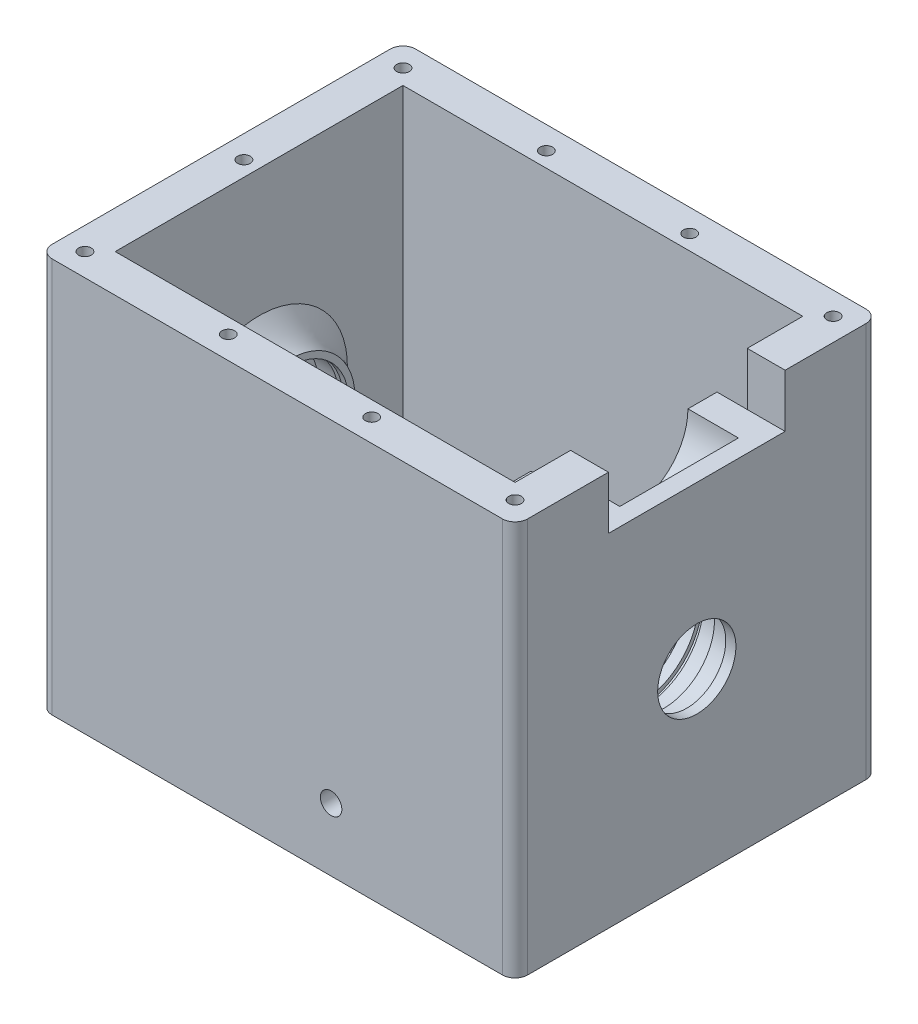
ISO-10303-21;
HEADER;
FILE_DESCRIPTION(('STEP AP214'),'2;1');
FILE_NAME('part.step','',(''),(''),'','','');
FILE_SCHEMA(('AUTOMOTIVE_DESIGN { 1 0 10303 214 1 1 1 1 }'));
ENDSEC;
DATA;
#1=APPLICATION_CONTEXT('core data for automotive mechanical design processes');
#2=APPLICATION_PROTOCOL_DEFINITION('international standard','automotive_design',2000,#1);
#3=PRODUCT_CONTEXT('',#1,'mechanical');
#4=PRODUCT('Part','Part','',(#3));
#5=PRODUCT_RELATED_PRODUCT_CATEGORY('part','',(#4));
#6=PRODUCT_DEFINITION_FORMATION('','',#4);
#7=PRODUCT_DEFINITION_CONTEXT('part definition',#1,'design');
#8=PRODUCT_DEFINITION('design','',#6,#7);
#9=PRODUCT_DEFINITION_SHAPE('','',#8);
#10=(LENGTH_UNIT() NAMED_UNIT(*) SI_UNIT(.MILLI.,.METRE.));
#11=(NAMED_UNIT(*) PLANE_ANGLE_UNIT() SI_UNIT($,.RADIAN.));
#12=(NAMED_UNIT(*) SI_UNIT($,.STERADIAN.) SOLID_ANGLE_UNIT());
#13=UNCERTAINTY_MEASURE_WITH_UNIT(LENGTH_MEASURE(1.E-05),#10,'distance_accuracy_value','');
#14=(GEOMETRIC_REPRESENTATION_CONTEXT(3) GLOBAL_UNCERTAINTY_ASSIGNED_CONTEXT((#13)) GLOBAL_UNIT_ASSIGNED_CONTEXT((#10,
#11,#12)) REPRESENTATION_CONTEXT('',''));
#15=CARTESIAN_POINT('',(0.,0.,0.));
#16=DIRECTION('',(0.,0.,1.));
#17=DIRECTION('',(1.,0.,0.));
#18=AXIS2_PLACEMENT_3D('',#15,#16,#17);
#19=CARTESIAN_POINT('',(0.,156.5,144.));
#20=DIRECTION('',(0.,-1.,0.));
#21=DIRECTION('',(0.,0.,-1.));
#22=AXIS2_PLACEMENT_3D('',#19,#20,#21);
#23=PLANE('',#22);
#24=CARTESIAN_POINT('',(9.,156.5,72.));
#25=DIRECTION('',(0.,1.,0.));
#26=DIRECTION('',(0.,0.,1.));
#27=AXIS2_PLACEMENT_3D('',#24,#25,#26);
#28=CIRCLE('',#27,2.5);
#29=CARTESIAN_POINT('',(9.,156.5,74.5));
#30=VERTEX_POINT('',#29);
#31=EDGE_CURVE('E370',#30,#30,#28,.T.);
#32=ORIENTED_EDGE('',*,*,#31,.F.);
#33=EDGE_LOOP('',(#32));
#34=FACE_BOUND('',#33,.T.);
#35=CARTESIAN_POINT('',(9.,156.5,8.99999999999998));
#36=DIRECTION('',(0.,1.,0.));
#37=DIRECTION('',(0.,0.,1.));
#38=AXIS2_PLACEMENT_3D('',#35,#36,#37);
#39=CIRCLE('',#38,2.5);
#40=CARTESIAN_POINT('',(9.,156.5,11.5));
#41=VERTEX_POINT('',#40);
#42=EDGE_CURVE('E394',#41,#41,#39,.T.);
#43=ORIENTED_EDGE('',*,*,#42,.F.);
#44=EDGE_LOOP('',(#43));
#45=FACE_BOUND('',#44,.T.);
#46=CARTESIAN_POINT('',(9.,156.5,135.));
#47=DIRECTION('',(0.,1.,0.));
#48=DIRECTION('',(0.,0.,1.));
#49=AXIS2_PLACEMENT_3D('',#46,#47,#48);
#50=CIRCLE('',#49,2.5);
#51=CARTESIAN_POINT('',(9.,156.5,137.5));
#52=VERTEX_POINT('',#51);
#53=EDGE_CURVE('E418',#52,#52,#50,.T.);
#54=ORIENTED_EDGE('',*,*,#53,.F.);
#55=EDGE_LOOP('',(#54));
#56=FACE_BOUND('',#55,.T.);
#57=DIRECTION('',(0.,0.,-1.));
#58=VECTOR('',#57,1.);
#59=CARTESIAN_POINT('',(188.4,156.5,144.));
#60=LINE('',#59,#58);
#61=CARTESIAN_POINT('',(188.4,156.5,139.));
#62=VERTEX_POINT('',#61);
#63=CARTESIAN_POINT('',(188.4,156.5,107.));
#64=VERTEX_POINT('',#63);
#65=EDGE_CURVE('E991',#62,#64,#60,.T.);
#66=ORIENTED_EDGE('',*,*,#65,.T.);
#67=DIRECTION('',(1.,0.,0.));
#68=VECTOR('',#67,1.);
#69=CARTESIAN_POINT('',(-0.001000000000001,156.5,107.));
#70=LINE('',#69,#68);
#71=CARTESIAN_POINT('',(173.4,156.5,107.));
#72=VERTEX_POINT('',#71);
#73=EDGE_CURVE('E507',#72,#64,#70,.T.);
#74=ORIENTED_EDGE('',*,*,#73,.F.);
#75=DIRECTION('',(0.,0.,-1.));
#76=VECTOR('',#75,1.);
#77=CARTESIAN_POINT('',(173.4,156.5,144.));
#78=LINE('',#77,#76);
#79=CARTESIAN_POINT('',(173.4,156.5,129.));
#80=VERTEX_POINT('',#79);
#81=EDGE_CURVE('E1040',#80,#72,#78,.T.);
#82=ORIENTED_EDGE('',*,*,#81,.F.);
#83=DIRECTION('',(-1.,0.,0.));
#84=VECTOR('',#83,1.);
#85=CARTESIAN_POINT('',(0.,156.5,129.));
#86=LINE('',#85,#84);
#87=CARTESIAN_POINT('',(15.,156.5,129.));
#88=VERTEX_POINT('',#87);
#89=EDGE_CURVE('E1034',#80,#88,#86,.T.);
#90=ORIENTED_EDGE('',*,*,#89,.T.);
#91=DIRECTION('',(0.,0.,-1.));
#92=VECTOR('',#91,1.);
#93=CARTESIAN_POINT('',(15.,156.5,144.));
#94=LINE('',#93,#92);
#95=CARTESIAN_POINT('',(15.,156.5,15.));
#96=VERTEX_POINT('',#95);
#97=EDGE_CURVE('E1035',#88,#96,#94,.T.);
#98=ORIENTED_EDGE('',*,*,#97,.T.);
#99=DIRECTION('',(-1.,0.,0.));
#100=VECTOR('',#99,1.);
#101=CARTESIAN_POINT('',(0.,156.5,15.));
#102=LINE('',#101,#100);
#103=CARTESIAN_POINT('',(173.4,156.5,15.));
#104=VERTEX_POINT('',#103);
#105=EDGE_CURVE('E983',#104,#96,#102,.T.);
#106=ORIENTED_EDGE('',*,*,#105,.F.);
#107=CARTESIAN_POINT('',(173.4,156.5,37.));
#108=VERTEX_POINT('',#107);
#109=EDGE_CURVE('E1038',#108,#104,#78,.T.);
#110=ORIENTED_EDGE('',*,*,#109,.F.);
#111=DIRECTION('',(1.,0.,0.));
#112=VECTOR('',#111,1.);
#113=CARTESIAN_POINT('',(-0.001000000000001,156.5,37.));
#114=LINE('',#113,#112);
#115=CARTESIAN_POINT('',(188.4,156.5,37.));
#116=VERTEX_POINT('',#115);
#117=EDGE_CURVE('E515',#108,#116,#114,.T.);
#118=ORIENTED_EDGE('',*,*,#117,.T.);
#119=CARTESIAN_POINT('',(188.4,156.5,5.));
#120=VERTEX_POINT('',#119);
#121=EDGE_CURVE('E990',#116,#120,#60,.T.);
#122=ORIENTED_EDGE('',*,*,#121,.T.);
#123=CARTESIAN_POINT('',(183.4,156.5,5.));
#124=DIRECTION('',(0.,-1.,0.));
#125=DIRECTION('',(0.,0.,-1.));
#126=AXIS2_PLACEMENT_3D('',#123,#124,#125);
#127=CIRCLE('',#126,5.);
#128=CARTESIAN_POINT('',(183.4,156.5,0.));
#129=VERTEX_POINT('',#128);
#130=EDGE_CURVE('E782',#120,#129,#127,.F.);
#131=ORIENTED_EDGE('',*,*,#130,.T.);
#132=DIRECTION('',(-1.,0.,0.));
#133=VECTOR('',#132,1.);
#134=CARTESIAN_POINT('',(0.,156.5,0.));
#135=LINE('',#134,#133);
#136=CARTESIAN_POINT('',(5.,156.5,0.));
#137=VERTEX_POINT('',#136);
#138=EDGE_CURVE('E975',#129,#137,#135,.T.);
#139=ORIENTED_EDGE('',*,*,#138,.T.);
#140=CARTESIAN_POINT('',(5.,156.5,5.));
#141=DIRECTION('',(0.,-1.,0.));
#142=DIRECTION('',(0.,0.,-1.));
#143=AXIS2_PLACEMENT_3D('',#140,#141,#142);
#144=CIRCLE('',#143,5.);
#145=CARTESIAN_POINT('',(0.,156.5,5.));
#146=VERTEX_POINT('',#145);
#147=EDGE_CURVE('E784',#137,#146,#144,.F.);
#148=ORIENTED_EDGE('',*,*,#147,.T.);
#149=DIRECTION('',(0.,0.,-1.));
#150=VECTOR('',#149,1.);
#151=CARTESIAN_POINT('',(0.,156.5,144.));
#152=LINE('',#151,#150);
#153=CARTESIAN_POINT('',(0.,156.5,139.));
#154=VERTEX_POINT('',#153);
#155=EDGE_CURVE('E977',#154,#146,#152,.T.);
#156=ORIENTED_EDGE('',*,*,#155,.F.);
#157=CARTESIAN_POINT('',(5.,156.5,139.));
#158=DIRECTION('',(0.,-1.,0.));
#159=DIRECTION('',(0.,0.,-1.));
#160=AXIS2_PLACEMENT_3D('',#157,#158,#159);
#161=CIRCLE('',#160,5.);
#162=CARTESIAN_POINT('',(5.,156.5,144.));
#163=VERTEX_POINT('',#162);
#164=EDGE_CURVE('E786',#154,#163,#161,.F.);
#165=ORIENTED_EDGE('',*,*,#164,.T.);
#166=DIRECTION('',(-1.,0.,0.));
#167=VECTOR('',#166,1.);
#168=CARTESIAN_POINT('',(0.,156.5,144.));
#169=LINE('',#168,#167);
#170=CARTESIAN_POINT('',(183.4,156.5,144.));
#171=VERTEX_POINT('',#170);
#172=EDGE_CURVE('E970',#171,#163,#169,.T.);
#173=ORIENTED_EDGE('',*,*,#172,.F.);
#174=CARTESIAN_POINT('',(183.4,156.5,139.));
#175=DIRECTION('',(0.,-1.,0.));
#176=DIRECTION('',(0.,0.,-1.));
#177=AXIS2_PLACEMENT_3D('',#174,#175,#176);
#178=CIRCLE('',#177,5.);
#179=EDGE_CURVE('E780',#171,#62,#178,.F.);
#180=ORIENTED_EDGE('',*,*,#179,.T.);
#181=EDGE_LOOP('',(#66,#74,#82,#90,#98,#106,#110,#118,#122,#131,#139,#148,#156,#165,#173,#180));
#182=FACE_BOUND('',#181,.T.);
#183=CARTESIAN_POINT('',(65.8,156.5,135.));
#184=DIRECTION('',(0.,1.,0.));
#185=DIRECTION('',(0.,0.,1.));
#186=AXIS2_PLACEMENT_3D('',#183,#184,#185);
#187=CIRCLE('',#186,2.5);
#188=CARTESIAN_POINT('',(65.8,156.5,137.5));
#189=VERTEX_POINT('',#188);
#190=EDGE_CURVE('E412',#189,#189,#187,.T.);
#191=ORIENTED_EDGE('',*,*,#190,.F.);
#192=EDGE_LOOP('',(#191));
#193=FACE_BOUND('',#192,.T.);
#194=CARTESIAN_POINT('',(122.6,156.5,135.));
#195=DIRECTION('',(0.,1.,0.));
#196=DIRECTION('',(0.,0.,1.));
#197=AXIS2_PLACEMENT_3D('',#194,#195,#196);
#198=CIRCLE('',#197,2.49999999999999);
#199=CARTESIAN_POINT('',(122.6,156.5,137.5));
#200=VERTEX_POINT('',#199);
#201=EDGE_CURVE('E406',#200,#200,#198,.T.);
#202=ORIENTED_EDGE('',*,*,#201,.F.);
#203=EDGE_LOOP('',(#202));
#204=FACE_BOUND('',#203,.T.);
#205=CARTESIAN_POINT('',(179.4,156.5,135.));
#206=DIRECTION('',(0.,1.,0.));
#207=DIRECTION('',(0.,0.,1.));
#208=AXIS2_PLACEMENT_3D('',#205,#206,#207);
#209=CIRCLE('',#208,2.5);
#210=CARTESIAN_POINT('',(179.4,156.5,137.5));
#211=VERTEX_POINT('',#210);
#212=EDGE_CURVE('E400',#211,#211,#209,.T.);
#213=ORIENTED_EDGE('',*,*,#212,.F.);
#214=EDGE_LOOP('',(#213));
#215=FACE_BOUND('',#214,.T.);
#216=CARTESIAN_POINT('',(65.8,156.5,8.99999999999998));
#217=DIRECTION('',(0.,1.,0.));
#218=DIRECTION('',(0.,0.,1.));
#219=AXIS2_PLACEMENT_3D('',#216,#217,#218);
#220=CIRCLE('',#219,2.5);
#221=CARTESIAN_POINT('',(65.8,156.5,11.5));
#222=VERTEX_POINT('',#221);
#223=EDGE_CURVE('E388',#222,#222,#220,.T.);
#224=ORIENTED_EDGE('',*,*,#223,.F.);
#225=EDGE_LOOP('',(#224));
#226=FACE_BOUND('',#225,.T.);
#227=CARTESIAN_POINT('',(122.6,156.5,8.99999999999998));
#228=DIRECTION('',(0.,1.,0.));
#229=DIRECTION('',(0.,0.,1.));
#230=AXIS2_PLACEMENT_3D('',#227,#228,#229);
#231=CIRCLE('',#230,2.49999999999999);
#232=CARTESIAN_POINT('',(122.6,156.5,11.5));
#233=VERTEX_POINT('',#232);
#234=EDGE_CURVE('E382',#233,#233,#231,.T.);
#235=ORIENTED_EDGE('',*,*,#234,.F.);
#236=EDGE_LOOP('',(#235));
#237=FACE_BOUND('',#236,.T.);
#238=CARTESIAN_POINT('',(179.4,156.5,8.99999999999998));
#239=DIRECTION('',(0.,1.,0.));
#240=DIRECTION('',(0.,0.,1.));
#241=AXIS2_PLACEMENT_3D('',#238,#239,#240);
#242=CIRCLE('',#241,2.5);
#243=CARTESIAN_POINT('',(179.4,156.5,11.5));
#244=VERTEX_POINT('',#243);
#245=EDGE_CURVE('E376',#244,#244,#242,.T.);
#246=ORIENTED_EDGE('',*,*,#245,.F.);
#247=EDGE_LOOP('',(#246));
#248=FACE_BOUND('',#247,.T.);
#249=ADVANCED_FACE('F41',(#34,#45,#56,#182,#193,#204,#215,#226,#237,#248),#23,.F.);
#250=CARTESIAN_POINT('',(175.4,71.5,72.));
#251=DIRECTION('',(-1.,0.,0.));
#252=DIRECTION('',(0.,0.,1.));
#253=AXIS2_PLACEMENT_3D('',#250,#251,#252);
#254=CYLINDRICAL_SURFACE('',#253,23.4999999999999);
#255=CARTESIAN_POINT('',(161.4,71.5,72.));
#256=DIRECTION('',(-1.,0.,0.));
#257=DIRECTION('',(0.,0.,1.));
#258=AXIS2_PLACEMENT_3D('',#255,#256,#257);
#259=CIRCLE('',#258,23.4999999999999);
#260=CARTESIAN_POINT('',(161.4,71.5,95.4999999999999));
#261=VERTEX_POINT('',#260);
#262=EDGE_CURVE('E462',#261,#261,#259,.T.);
#263=ORIENTED_EDGE('',*,*,#262,.T.);
#264=EDGE_LOOP('',(#263));
#265=FACE_BOUND('',#264,.T.);
#266=CARTESIAN_POINT('',(165.65,71.5,72.));
#267=DIRECTION('',(1.,0.,0.));
#268=DIRECTION('',(0.,1.,0.));
#269=AXIS2_PLACEMENT_3D('',#266,#267,#268);
#270=CIRCLE('',#269,23.4999999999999);
#271=CARTESIAN_POINT('',(165.65,94.9999999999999,72.));
#272=VERTEX_POINT('',#271);
#273=EDGE_CURVE('E45',#272,#272,#270,.F.);
#274=ORIENTED_EDGE('',*,*,#273,.F.);
#275=EDGE_LOOP('',(#274));
#276=FACE_BOUND('',#275,.T.);
#277=ADVANCED_FACE('F725',(#265,#276),#254,.F.);
#278=CARTESIAN_POINT('',(173.4,0.,144.));
#279=DIRECTION('',(-1.,0.,0.));
#280=DIRECTION('',(0.,0.,1.));
#281=AXIS2_PLACEMENT_3D('',#278,#279,#280);
#282=PLANE('',#281);
#283=DIRECTION('',(0.,1.,0.));
#284=VECTOR('',#283,1.);
#285=CARTESIAN_POINT('',(173.4,-56.0211236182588,37.));
#286=LINE('',#285,#284);
#287=CARTESIAN_POINT('',(173.4,15.,37.));
#288=VERTEX_POINT('',#287);
#289=CARTESIAN_POINT('',(173.4,135.5,37.));
#290=VERTEX_POINT('',#289);
#291=EDGE_CURVE('E494',#288,#290,#286,.T.);
#292=ORIENTED_EDGE('',*,*,#291,.T.);
#293=DIRECTION('',(0.,1.,0.));
#294=VECTOR('',#293,1.);
#295=CARTESIAN_POINT('',(173.4,156.5,37.));
#296=LINE('',#295,#294);
#297=EDGE_CURVE('E512',#290,#108,#296,.T.);
#298=ORIENTED_EDGE('',*,*,#297,.T.);
#299=ORIENTED_EDGE('',*,*,#109,.T.);
#300=DIRECTION('',(0.,1.,0.));
#301=VECTOR('',#300,1.);
#302=CARTESIAN_POINT('',(173.4,156.5,15.));
#303=LINE('',#302,#301);
#304=CARTESIAN_POINT('',(173.4,15.,15.));
#305=VERTEX_POINT('',#304);
#306=EDGE_CURVE('E1024',#305,#104,#303,.T.);
#307=ORIENTED_EDGE('',*,*,#306,.F.);
#308=DIRECTION('',(0.,0.,-1.));
#309=VECTOR('',#308,1.);
#310=CARTESIAN_POINT('',(173.4,15.,144.));
#311=LINE('',#310,#309);
#312=EDGE_CURVE('E1027',#288,#305,#311,.T.);
#313=ORIENTED_EDGE('',*,*,#312,.F.);
#314=EDGE_LOOP('',(#292,#298,#299,#307,#313));
#315=FACE_BOUND('',#314,.T.);
#316=ADVANCED_FACE('F708',(#315),#282,.T.);
#317=CARTESIAN_POINT('',(99.7,71.5,107.));
#318=DIRECTION('',(0.,-1.,0.));
#319=DIRECTION('',(0.,0.,-1.));
#320=AXIS2_PLACEMENT_3D('',#317,#318,#319);
#321=PLANE('',#320);
#322=CARTESIAN_POINT('',(124.7,71.5,101.));
#323=DIRECTION('',(0.,1.,0.));
#324=DIRECTION('',(0.,0.,1.));
#325=AXIS2_PLACEMENT_3D('',#322,#323,#324);
#326=CIRCLE('',#325,1.64999999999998);
#327=CARTESIAN_POINT('',(124.7,71.5,102.65));
#328=VERTEX_POINT('',#327);
#329=EDGE_CURVE('E343',#328,#328,#326,.T.);
#330=ORIENTED_EDGE('',*,*,#329,.F.);
#331=EDGE_LOOP('',(#330));
#332=FACE_BOUND('',#331,.T.);
#333=DIRECTION('',(0.,0.,1.));
#334=VECTOR('',#333,1.);
#335=CARTESIAN_POINT('',(129.7,71.5,37.));
#336=LINE('',#335,#334);
#337=CARTESIAN_POINT('',(129.7,71.5,95.5));
#338=VERTEX_POINT('',#337);
#339=CARTESIAN_POINT('',(129.7,71.5,107.));
#340=VERTEX_POINT('',#339);
#341=EDGE_CURVE('E539',#338,#340,#336,.T.);
#342=ORIENTED_EDGE('',*,*,#341,.F.);
#343=DIRECTION('',(-1.,0.,0.));
#344=VECTOR('',#343,1.);
#345=CARTESIAN_POINT('',(188.401,71.5,95.5));
#346=LINE('',#345,#344);
#347=CARTESIAN_POINT('',(119.7,71.5,95.5));
#348=VERTEX_POINT('',#347);
#349=EDGE_CURVE('E528',#348,#338,#346,.F.);
#350=ORIENTED_EDGE('',*,*,#349,.F.);
#351=DIRECTION('',(0.,0.,-1.));
#352=VECTOR('',#351,1.);
#353=CARTESIAN_POINT('',(119.7,71.5,37.));
#354=LINE('',#353,#352);
#355=CARTESIAN_POINT('',(119.7,71.5,107.));
#356=VERTEX_POINT('',#355);
#357=EDGE_CURVE('E543',#356,#348,#354,.T.);
#358=ORIENTED_EDGE('',*,*,#357,.F.);
#359=DIRECTION('',(-1.,0.,0.));
#360=VECTOR('',#359,1.);
#361=CARTESIAN_POINT('',(119.7,71.5,107.));
#362=LINE('',#361,#360);
#363=EDGE_CURVE('E538',#340,#356,#362,.T.);
#364=ORIENTED_EDGE('',*,*,#363,.F.);
#365=EDGE_LOOP('',(#342,#350,#358,#364));
#366=FACE_BOUND('',#365,.T.);
#367=ADVANCED_FACE('F701',(#332,#366),#321,.F.);
#368=CARTESIAN_POINT('',(0.,15.,144.));
#369=DIRECTION('',(0.,1.,0.));
#370=DIRECTION('',(0.,0.,1.));
#371=AXIS2_PLACEMENT_3D('',#368,#369,#370);
#372=PLANE('',#371);
#373=DIRECTION('',(1.,0.,0.));
#374=VECTOR('',#373,1.);
#375=CARTESIAN_POINT('',(161.4,15.,37.));
#376=LINE('',#375,#374);
#377=CARTESIAN_POINT('',(161.4,15.,37.));
#378=VERTEX_POINT('',#377);
#379=EDGE_CURVE('E478',#378,#288,#376,.T.);
#380=ORIENTED_EDGE('',*,*,#379,.T.);
#381=ORIENTED_EDGE('',*,*,#312,.T.);
#382=DIRECTION('',(1.,0.,0.));
#383=VECTOR('',#382,1.);
#384=CARTESIAN_POINT('',(0.,15.,15.));
#385=LINE('',#384,#383);
#386=CARTESIAN_POINT('',(15.,15.,15.));
#387=VERTEX_POINT('',#386);
#388=EDGE_CURVE('E1014',#387,#305,#385,.T.);
#389=ORIENTED_EDGE('',*,*,#388,.F.);
#390=DIRECTION('',(0.,0.,-1.));
#391=VECTOR('',#390,1.);
#392=CARTESIAN_POINT('',(15.,15.,144.));
#393=LINE('',#392,#391);
#394=CARTESIAN_POINT('',(15.,15.,129.));
#395=VERTEX_POINT('',#394);
#396=EDGE_CURVE('E986',#395,#387,#393,.T.);
#397=ORIENTED_EDGE('',*,*,#396,.F.);
#398=DIRECTION('',(1.,0.,0.));
#399=VECTOR('',#398,1.);
#400=CARTESIAN_POINT('',(0.,15.,129.));
#401=LINE('',#400,#399);
#402=CARTESIAN_POINT('',(173.4,15.,129.));
#403=VERTEX_POINT('',#402);
#404=EDGE_CURVE('E1021',#395,#403,#401,.T.);
#405=ORIENTED_EDGE('',*,*,#404,.T.);
#406=CARTESIAN_POINT('',(173.4,15.,107.));
#407=VERTEX_POINT('',#406);
#408=EDGE_CURVE('E1017',#403,#407,#311,.T.);
#409=ORIENTED_EDGE('',*,*,#408,.T.);
#410=DIRECTION('',(-1.,0.,0.));
#411=VECTOR('',#410,1.);
#412=CARTESIAN_POINT('',(161.4,15.,107.));
#413=LINE('',#412,#411);
#414=CARTESIAN_POINT('',(161.4,15.,107.));
#415=VERTEX_POINT('',#414);
#416=EDGE_CURVE('E482',#407,#415,#413,.T.);
#417=ORIENTED_EDGE('',*,*,#416,.T.);
#418=DIRECTION('',(0.,0.,-1.));
#419=VECTOR('',#418,1.);
#420=CARTESIAN_POINT('',(161.4,15.,107.));
#421=LINE('',#420,#419);
#422=EDGE_CURVE('E66',#415,#378,#421,.T.);
#423=ORIENTED_EDGE('',*,*,#422,.T.);
#424=EDGE_LOOP('',(#380,#381,#389,#397,#405,#409,#417,#423));
#425=FACE_BOUND('',#424,.T.);
#426=DIRECTION('',(-1.,0.,0.));
#427=VECTOR('',#426,1.);
#428=CARTESIAN_POINT('',(99.7,15.,37.));
#429=LINE('',#428,#427);
#430=CARTESIAN_POINT('',(99.7,15.,37.));
#431=VERTEX_POINT('',#430);
#432=CARTESIAN_POINT('',(87.7,15.,37.));
#433=VERTEX_POINT('',#432);
#434=EDGE_CURVE('E614',#431,#433,#429,.T.);
#435=ORIENTED_EDGE('',*,*,#434,.F.);
#436=DIRECTION('',(0.,0.,-1.));
#437=VECTOR('',#436,1.);
#438=CARTESIAN_POINT('',(99.7,15.,37.));
#439=LINE('',#438,#437);
#440=CARTESIAN_POINT('',(99.7,15.,107.));
#441=VERTEX_POINT('',#440);
#442=EDGE_CURVE('E598',#441,#431,#439,.T.);
#443=ORIENTED_EDGE('',*,*,#442,.F.);
#444=DIRECTION('',(1.,0.,0.));
#445=VECTOR('',#444,1.);
#446=CARTESIAN_POINT('',(99.7,15.,107.));
#447=LINE('',#446,#445);
#448=CARTESIAN_POINT('',(87.7,15.,107.));
#449=VERTEX_POINT('',#448);
#450=EDGE_CURVE('E619',#449,#441,#447,.T.);
#451=ORIENTED_EDGE('',*,*,#450,.F.);
#452=DIRECTION('',(0.,0.,1.));
#453=VECTOR('',#452,1.);
#454=CARTESIAN_POINT('',(87.7,15.,37.));
#455=LINE('',#454,#453);
#456=EDGE_CURVE('E616',#433,#449,#455,.T.);
#457=ORIENTED_EDGE('',*,*,#456,.F.);
#458=EDGE_LOOP('',(#435,#443,#451,#457));
#459=FACE_BOUND('',#458,.T.);
#460=DIRECTION('',(0.,0.,1.));
#461=VECTOR('',#460,1.);
#462=CARTESIAN_POINT('',(119.7,15.,37.));
#463=LINE('',#462,#461);
#464=CARTESIAN_POINT('',(119.7,15.,37.));
#465=VERTEX_POINT('',#464);
#466=CARTESIAN_POINT('',(119.7,15.,107.));
#467=VERTEX_POINT('',#466);
#468=EDGE_CURVE('E534',#465,#467,#463,.T.);
#469=ORIENTED_EDGE('',*,*,#468,.F.);
#470=DIRECTION('',(-1.,0.,0.));
#471=VECTOR('',#470,1.);
#472=CARTESIAN_POINT('',(119.7,15.,37.));
#473=LINE('',#472,#471);
#474=CARTESIAN_POINT('',(129.7,15.,37.));
#475=VERTEX_POINT('',#474);
#476=EDGE_CURVE('E555',#475,#465,#473,.T.);
#477=ORIENTED_EDGE('',*,*,#476,.F.);
#478=DIRECTION('',(0.,0.,-1.));
#479=VECTOR('',#478,1.);
#480=CARTESIAN_POINT('',(129.7,15.,37.));
#481=LINE('',#480,#479);
#482=CARTESIAN_POINT('',(129.7,15.,107.));
#483=VERTEX_POINT('',#482);
#484=EDGE_CURVE('E552',#483,#475,#481,.T.);
#485=ORIENTED_EDGE('',*,*,#484,.F.);
#486=DIRECTION('',(1.,0.,0.));
#487=VECTOR('',#486,1.);
#488=CARTESIAN_POINT('',(119.7,15.,107.));
#489=LINE('',#488,#487);
#490=EDGE_CURVE('E549',#467,#483,#489,.T.);
#491=ORIENTED_EDGE('',*,*,#490,.F.);
#492=EDGE_LOOP('',(#469,#477,#485,#491));
#493=FACE_BOUND('',#492,.T.);
#494=ADVANCED_FACE('F697',(#425,#459,#493),#372,.T.);
#495=CARTESIAN_POINT('',(188.401,71.5,72.));
#496=DIRECTION('',(-1.,0.,0.));
#497=DIRECTION('',(0.,0.,1.));
#498=AXIS2_PLACEMENT_3D('',#495,#496,#497);
#499=CYLINDRICAL_SURFACE('',#498,21.);
#500=CARTESIAN_POINT('',(97.6999999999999,71.5,72.));
#501=DIRECTION('',(-1.,0.,0.));
#502=DIRECTION('',(0.,0.,1.));
#503=AXIS2_PLACEMENT_3D('',#500,#501,#502);
#504=CIRCLE('',#503,21.);
#505=CARTESIAN_POINT('',(97.6999999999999,71.5,93.));
#506=VERTEX_POINT('',#505);
#507=CARTESIAN_POINT('',(97.6999999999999,71.5,51.));
#508=VERTEX_POINT('',#507);
#509=EDGE_CURVE('E951',#506,#508,#504,.F.);
#510=ORIENTED_EDGE('',*,*,#509,.F.);
#511=DIRECTION('',(-1.,0.,0.));
#512=VECTOR('',#511,1.);
#513=CARTESIAN_POINT('',(188.401,71.5,93.));
#514=LINE('',#513,#512);
#515=CARTESIAN_POINT('',(99.7,71.5,93.));
#516=VERTEX_POINT('',#515);
#517=EDGE_CURVE('E590',#506,#516,#514,.F.);
#518=ORIENTED_EDGE('',*,*,#517,.T.);
#519=CARTESIAN_POINT('',(99.7,71.5,72.));
#520=DIRECTION('',(-1.,0.,0.));
#521=DIRECTION('',(0.,0.,1.));
#522=AXIS2_PLACEMENT_3D('',#519,#520,#521);
#523=CIRCLE('',#522,21.);
#524=CARTESIAN_POINT('',(99.7,71.5,51.));
#525=VERTEX_POINT('',#524);
#526=EDGE_CURVE('E596',#516,#525,#523,.F.);
#527=ORIENTED_EDGE('',*,*,#526,.T.);
#528=DIRECTION('',(-1.,0.,0.));
#529=VECTOR('',#528,1.);
#530=CARTESIAN_POINT('',(188.401,71.5,51.));
#531=LINE('',#530,#529);
#532=EDGE_CURVE('E587',#525,#508,#531,.T.);
#533=ORIENTED_EDGE('',*,*,#532,.T.);
#534=EDGE_LOOP('',(#510,#518,#527,#533));
#535=FACE_BOUND('',#534,.T.);
#536=ADVANCED_FACE('F700',(#535),#499,.F.);
#537=CARTESIAN_POINT('',(99.7,71.5,107.));
#538=DIRECTION('',(0.,-1.,0.));
#539=DIRECTION('',(0.,0.,-1.));
#540=AXIS2_PLACEMENT_3D('',#537,#538,#539);
#541=PLANE('',#540);
#542=CARTESIAN_POINT('',(93.7,71.5,101.));
#543=DIRECTION('',(0.,1.,0.));
#544=DIRECTION('',(0.,0.,1.));
#545=AXIS2_PLACEMENT_3D('',#542,#543,#544);
#546=CIRCLE('',#545,1.64999999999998);
#547=CARTESIAN_POINT('',(93.7,71.5,102.65));
#548=VERTEX_POINT('',#547);
#549=EDGE_CURVE('E355',#548,#548,#546,.T.);
#550=ORIENTED_EDGE('',*,*,#549,.F.);
#551=EDGE_LOOP('',(#550));
#552=FACE_BOUND('',#551,.T.);
#553=DIRECTION('',(1.,0.,0.));
#554=VECTOR('',#553,1.);
#555=CARTESIAN_POINT('',(89.7,71.5,95.5));
#556=LINE('',#555,#554);
#557=CARTESIAN_POINT('',(89.7,71.5,95.5));
#558=VERTEX_POINT('',#557);
#559=CARTESIAN_POINT('',(97.7,71.5,95.5));
#560=VERTEX_POINT('',#559);
#561=EDGE_CURVE('E584',#558,#560,#556,.T.);
#562=ORIENTED_EDGE('',*,*,#561,.F.);
#563=DIRECTION('',(0.,0.,-1.));
#564=VECTOR('',#563,1.);
#565=CARTESIAN_POINT('',(89.6999999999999,71.5,107.));
#566=LINE('',#565,#564);
#567=CARTESIAN_POINT('',(89.6999999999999,71.5,93.));
#568=VERTEX_POINT('',#567);
#569=EDGE_CURVE('E581',#558,#568,#566,.T.);
#570=ORIENTED_EDGE('',*,*,#569,.T.);
#571=CARTESIAN_POINT('',(87.7,71.5,93.));
#572=VERTEX_POINT('',#571);
#573=EDGE_CURVE('E591',#572,#568,#514,.F.);
#574=ORIENTED_EDGE('',*,*,#573,.F.);
#575=DIRECTION('',(0.,0.,1.));
#576=VECTOR('',#575,1.);
#577=CARTESIAN_POINT('',(87.7,71.5,37.));
#578=LINE('',#577,#576);
#579=CARTESIAN_POINT('',(87.7,71.5,107.));
#580=VERTEX_POINT('',#579);
#581=EDGE_CURVE('E605',#572,#580,#578,.T.);
#582=ORIENTED_EDGE('',*,*,#581,.T.);
#583=DIRECTION('',(1.,0.,0.));
#584=VECTOR('',#583,1.);
#585=CARTESIAN_POINT('',(99.7,71.5,107.));
#586=LINE('',#585,#584);
#587=CARTESIAN_POINT('',(99.7,71.5,107.));
#588=VERTEX_POINT('',#587);
#589=EDGE_CURVE('E609',#580,#588,#586,.T.);
#590=ORIENTED_EDGE('',*,*,#589,.T.);
#591=DIRECTION('',(0.,0.,-1.));
#592=VECTOR('',#591,1.);
#593=CARTESIAN_POINT('',(99.7,71.5,37.));
#594=LINE('',#593,#592);
#595=EDGE_CURVE('E599',#588,#516,#594,.T.);
#596=ORIENTED_EDGE('',*,*,#595,.T.);
#597=ORIENTED_EDGE('',*,*,#517,.F.);
#598=DIRECTION('',(0.,0.,-1.));
#599=VECTOR('',#598,1.);
#600=CARTESIAN_POINT('',(97.6999999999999,71.5,107.));
#601=LINE('',#600,#599);
#602=EDGE_CURVE('E576',#560,#506,#601,.T.);
#603=ORIENTED_EDGE('',*,*,#602,.F.);
#604=EDGE_LOOP('',(#562,#570,#574,#582,#590,#596,#597,#603));
#605=FACE_BOUND('',#604,.T.);
#606=ADVANCED_FACE('F898',(#552,#605),#541,.F.);
#607=CARTESIAN_POINT('',(-51.4680374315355,71.,72.));
#608=DIRECTION('',(1.,0.,0.));
#609=DIRECTION('',(0.,0.,-1.));
#610=AXIS2_PLACEMENT_3D('',#607,#608,#609);
#611=CYLINDRICAL_SURFACE('',#610,23.5);
#612=CARTESIAN_POINT('',(27.,71.,72.));
#613=DIRECTION('',(1.,0.,0.));
#614=DIRECTION('',(0.,0.,-1.));
#615=AXIS2_PLACEMENT_3D('',#612,#613,#614);
#616=CIRCLE('',#615,23.5);
#617=CARTESIAN_POINT('',(27.,71.,48.5));
#618=VERTEX_POINT('',#617);
#619=EDGE_CURVE('E637',#618,#618,#616,.T.);
#620=CARTESIAN_POINT('',(24.75,71.,72.));
#621=DIRECTION('',(-1.,0.,0.));
#622=DIRECTION('',(0.,0.,1.));
#623=AXIS2_PLACEMENT_3D('',#620,#621,#622);
#624=CIRCLE('',#623,23.5);
#625=CARTESIAN_POINT('',(24.75,71.,48.5));
#626=VERTEX_POINT('',#625);
#627=EDGE_CURVE('E641',#626,#626,#624,.F.);
#628=CARTESIAN_POINT('',(27.,71.,48.5));
#629=CARTESIAN_POINT('',(26.9765625,71.,48.5));
#630=CARTESIAN_POINT('',(26.953125,71.,48.5));
#631=CARTESIAN_POINT('',(26.90625,71.,48.5));
#632=CARTESIAN_POINT('',(26.8828125,71.,48.5));
#633=CARTESIAN_POINT('',(26.8359375,71.,48.5));
#634=CARTESIAN_POINT('',(26.8125,71.,48.5));
#635=CARTESIAN_POINT('',(26.765625,71.,48.5));
#636=CARTESIAN_POINT('',(26.7421875,71.,48.5));
#637=CARTESIAN_POINT('',(26.6953125,71.,48.5));
#638=CARTESIAN_POINT('',(26.671875,71.,48.5));
#639=CARTESIAN_POINT('',(26.625,71.,48.5));
#640=CARTESIAN_POINT('',(26.6015625,71.,48.5));
#641=CARTESIAN_POINT('',(26.5546875,71.,48.5));
#642=CARTESIAN_POINT('',(26.53125,71.,48.5));
#643=CARTESIAN_POINT('',(26.484375,71.,48.5));
#644=CARTESIAN_POINT('',(26.4609375,71.,48.5));
#645=CARTESIAN_POINT('',(26.4140625,71.,48.5));
#646=CARTESIAN_POINT('',(26.390625,71.,48.5));
#647=CARTESIAN_POINT('',(26.34375,71.,48.5));
#648=CARTESIAN_POINT('',(26.3203125,71.,48.5));
#649=CARTESIAN_POINT('',(26.2734375,71.,48.5));
#650=CARTESIAN_POINT('',(26.25,71.,48.5));
#651=CARTESIAN_POINT('',(26.203125,71.,48.5));
#652=CARTESIAN_POINT('',(26.1796875,71.,48.5));
#653=CARTESIAN_POINT('',(26.1328125,71.,48.5));
#654=CARTESIAN_POINT('',(26.109375,71.,48.5));
#655=CARTESIAN_POINT('',(26.0625,71.,48.5));
#656=CARTESIAN_POINT('',(26.0390625,71.,48.5));
#657=CARTESIAN_POINT('',(25.9921875,71.,48.5));
#658=CARTESIAN_POINT('',(25.96875,71.,48.5));
#659=CARTESIAN_POINT('',(25.921875,71.,48.5));
#660=CARTESIAN_POINT('',(25.8984375,71.,48.5));
#661=CARTESIAN_POINT('',(25.8515625,71.,48.5));
#662=CARTESIAN_POINT('',(25.828125,71.,48.5));
#663=CARTESIAN_POINT('',(25.78125,71.,48.5));
#664=CARTESIAN_POINT('',(25.7578125,71.,48.5));
#665=CARTESIAN_POINT('',(25.7109375,71.,48.5));
#666=CARTESIAN_POINT('',(25.6875,71.,48.5));
#667=CARTESIAN_POINT('',(25.640625,71.,48.5));
#668=CARTESIAN_POINT('',(25.6171875,71.,48.5));
#669=CARTESIAN_POINT('',(25.5703125,71.,48.5));
#670=CARTESIAN_POINT('',(25.546875,71.,48.5));
#671=CARTESIAN_POINT('',(25.5,71.,48.5));
#672=CARTESIAN_POINT('',(25.4765625,71.,48.5));
#673=CARTESIAN_POINT('',(25.4296875,71.,48.5));
#674=CARTESIAN_POINT('',(25.40625,71.,48.5));
#675=CARTESIAN_POINT('',(25.359375,71.,48.5));
#676=CARTESIAN_POINT('',(25.3359375,71.,48.5));
#677=CARTESIAN_POINT('',(25.2890625,71.,48.5));
#678=CARTESIAN_POINT('',(25.265625,71.,48.5));
#679=CARTESIAN_POINT('',(25.21875,71.,48.5));
#680=CARTESIAN_POINT('',(25.1953125,71.,48.5));
#681=CARTESIAN_POINT('',(25.1484375,71.,48.5));
#682=CARTESIAN_POINT('',(25.125,71.,48.5));
#683=CARTESIAN_POINT('',(25.078125,71.,48.5));
#684=CARTESIAN_POINT('',(25.0546875,71.,48.5));
#685=CARTESIAN_POINT('',(25.0078125,71.,48.5));
#686=CARTESIAN_POINT('',(24.984375,71.,48.5));
#687=CARTESIAN_POINT('',(24.9375,71.,48.5));
#688=CARTESIAN_POINT('',(24.9140625,71.,48.5));
#689=CARTESIAN_POINT('',(24.8671875,71.,48.5));
#690=CARTESIAN_POINT('',(24.84375,71.,48.5));
#691=CARTESIAN_POINT('',(24.796875,71.,48.5));
#692=CARTESIAN_POINT('',(24.7734375,71.,48.5));
#693=CARTESIAN_POINT('',(24.75,71.,48.5));
#694=B_SPLINE_CURVE_WITH_KNOTS('',3,(#628,#629,#630,#631,#632,#633,#634,#635,#636,#637,#638,
#639,#640,#641,#642,#643,#644,#645,#646,#647,#648,#649,#650,#651,#652,#653,#654,#655,#656,#657,
#658,#659,#660,#661,#662,#663,#664,#665,#666,#667,#668,#669,#670,#671,#672,#673,#674,#675,#676,
#677,#678,#679,#680,#681,#682,#683,#684,#685,#686,#687,#688,#689,#690,#691,#692,#693),
.UNSPECIFIED.,.F.,.F.,(4,2,2,2,2,2,2,2,2,2,2,2,2,2,2,2,2,2,2,2,2,2,2,2,2,2,2,2,2,2,2,2,4),(0.,
0.0703125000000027,0.140625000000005,0.210937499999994,0.281249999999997,0.351562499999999,
0.421874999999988,0.492187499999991,0.562499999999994,0.632812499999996,0.703124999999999,
0.773437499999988,0.84374999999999,0.914062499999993,0.984374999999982,1.05468749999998,
1.12499999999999,1.19531249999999,1.26562499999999,1.33593749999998,1.40624999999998,
1.47656249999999,1.54687499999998,1.61718749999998,1.68749999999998,1.75781249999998,
1.82812499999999,1.89843749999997,1.96874999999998,2.03906249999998,2.10937499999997,
2.17968749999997,2.24999999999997),.UNSPECIFIED.);
#695=EDGE_CURVE('BSEAM695',#618,#626,#694,.T.);
#696=ORIENTED_EDGE('',*,*,#619,.T.);
#697=ORIENTED_EDGE('',*,*,#627,.F.);
#698=ORIENTED_EDGE('',*,*,#695,.T.);
#699=ORIENTED_EDGE('',*,*,#695,.F.);
#700=EDGE_LOOP('',(#696,#698,#697,#699));
#701=FACE_BOUND('',#700,.T.);
#702=ADVANCED_FACE('F695',(#701),#611,.F.);
#703=CARTESIAN_POINT('',(15.,0.,144.));
#704=DIRECTION('',(1.,0.,0.));
#705=DIRECTION('',(0.,0.,-1.));
#706=AXIS2_PLACEMENT_3D('',#703,#704,#705);
#707=PLANE('',#706);
#708=DIRECTION('',(0.,-1.,0.));
#709=VECTOR('',#708,1.);
#710=CARTESIAN_POINT('',(15.,156.5,15.));
#711=LINE('',#710,#709);
#712=EDGE_CURVE('E1003',#96,#387,#711,.T.);
#713=ORIENTED_EDGE('',*,*,#712,.F.);
#714=ORIENTED_EDGE('',*,*,#97,.F.);
#715=DIRECTION('',(0.,-1.,0.));
#716=VECTOR('',#715,1.);
#717=CARTESIAN_POINT('',(15.,156.5,129.));
#718=LINE('',#717,#716);
#719=EDGE_CURVE('E1018',#88,#395,#718,.T.);
#720=ORIENTED_EDGE('',*,*,#719,.T.);
#721=ORIENTED_EDGE('',*,*,#396,.T.);
#722=EDGE_LOOP('',(#713,#714,#720,#721));
#723=FACE_BOUND('',#722,.T.);
#724=CARTESIAN_POINT('',(15.,71.,72.));
#725=DIRECTION('',(1.,0.,0.));
#726=DIRECTION('',(0.,0.,-1.));
#727=AXIS2_PLACEMENT_3D('',#724,#725,#726);
#728=CIRCLE('',#727,35.);
#729=CARTESIAN_POINT('',(15.,105.900561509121,74.6364381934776));
#730=VERTEX_POINT('',#729);
#731=EDGE_CURVE('E647',#730,#730,#728,.T.);
#732=ORIENTED_EDGE('',*,*,#731,.F.);
#733=EDGE_LOOP('',(#732));
#734=FACE_BOUND('',#733,.T.);
#735=ADVANCED_FACE('F691',(#723,#734),#707,.T.);
#736=CARTESIAN_POINT('',(188.401,71.,72.));
#737=DIRECTION('',(-1.,0.,0.));
#738=DIRECTION('',(0.,0.,1.));
#739=AXIS2_PLACEMENT_3D('',#736,#737,#738);
#740=CYLINDRICAL_SURFACE('',#739,15.5);
#741=CARTESIAN_POINT('',(0.,71.,72.));
#742=DIRECTION('',(-1.,0.,0.));
#743=DIRECTION('',(0.,0.,1.));
#744=AXIS2_PLACEMENT_3D('',#741,#742,#743);
#745=CIRCLE('',#744,15.5);
#746=CARTESIAN_POINT('',(0.,71.,87.5));
#747=VERTEX_POINT('',#746);
#748=EDGE_CURVE('E998',#747,#747,#745,.T.);
#749=ORIENTED_EDGE('',*,*,#748,.T.);
#750=EDGE_LOOP('',(#749));
#751=FACE_BOUND('',#750,.T.);
#752=CARTESIAN_POINT('',(3.,71.,72.));
#753=DIRECTION('',(1.,0.,0.));
#754=DIRECTION('',(0.,0.,-1.));
#755=AXIS2_PLACEMENT_3D('',#752,#753,#754);
#756=CIRCLE('',#755,15.5);
#757=CARTESIAN_POINT('',(3.,71.,56.5));
#758=VERTEX_POINT('',#757);
#759=EDGE_CURVE('E996',#758,#758,#756,.F.);
#760=ORIENTED_EDGE('',*,*,#759,.F.);
#761=EDGE_LOOP('',(#760));
#762=FACE_BOUND('',#761,.T.);
#763=ADVANCED_FACE('F687',(#751,#762),#740,.F.);
#764=CARTESIAN_POINT('',(0.,0.,144.));
#765=DIRECTION('',(1.,0.,0.));
#766=DIRECTION('',(0.,0.,-1.));
#767=AXIS2_PLACEMENT_3D('',#764,#765,#766);
#768=PLANE('',#767);
#769=ORIENTED_EDGE('',*,*,#748,.F.);
#770=EDGE_LOOP('',(#769));
#771=FACE_BOUND('',#770,.T.);
#772=DIRECTION('',(0.,0.,-1.));
#773=VECTOR('',#772,1.);
#774=CARTESIAN_POINT('',(0.,0.,144.));
#775=LINE('',#774,#773);
#776=CARTESIAN_POINT('',(0.,0.,139.));
#777=VERTEX_POINT('',#776);
#778=CARTESIAN_POINT('',(0.,0.,5.));
#779=VERTEX_POINT('',#778);
#780=EDGE_CURVE('E954',#777,#779,#775,.T.);
#781=ORIENTED_EDGE('',*,*,#780,.F.);
#782=DIRECTION('',(0.,-1.,0.));
#783=VECTOR('',#782,1.);
#784=CARTESIAN_POINT('',(0.,0.,139.));
#785=LINE('',#784,#783);
#786=EDGE_CURVE('E778',#777,#154,#785,.F.);
#787=ORIENTED_EDGE('',*,*,#786,.T.);
#788=ORIENTED_EDGE('',*,*,#155,.T.);
#789=DIRECTION('',(0.,-1.,0.));
#790=VECTOR('',#789,1.);
#791=CARTESIAN_POINT('',(0.,0.,5.));
#792=LINE('',#791,#790);
#793=EDGE_CURVE('E775',#146,#779,#792,.T.);
#794=ORIENTED_EDGE('',*,*,#793,.T.);
#795=EDGE_LOOP('',(#781,#787,#788,#794));
#796=FACE_BOUND('',#795,.T.);
#797=ADVANCED_FACE('F690',(#771,#796),#768,.F.);
#798=CARTESIAN_POINT('',(0.,0.,144.));
#799=DIRECTION('',(0.,1.,0.));
#800=DIRECTION('',(0.,0.,1.));
#801=AXIS2_PLACEMENT_3D('',#798,#799,#800);
#802=PLANE('',#801);
#803=CARTESIAN_POINT('',(7.50000000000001,0.,124.));
#804=DIRECTION('',(0.,-1.,0.));
#805=DIRECTION('',(0.,0.,-1.));
#806=AXIS2_PLACEMENT_3D('',#803,#804,#805);
#807=CIRCLE('',#806,3.4);
#808=CARTESIAN_POINT('',(7.50000000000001,0.,120.6));
#809=VERTEX_POINT('',#808);
#810=EDGE_CURVE('E424',#809,#809,#807,.T.);
#811=ORIENTED_EDGE('',*,*,#810,.F.);
#812=EDGE_LOOP('',(#811));
#813=FACE_BOUND('',#812,.T.);
#814=CARTESIAN_POINT('',(180.9,0.,124.));
#815=DIRECTION('',(0.,-1.,0.));
#816=DIRECTION('',(0.,0.,-1.));
#817=AXIS2_PLACEMENT_3D('',#814,#815,#816);
#818=CIRCLE('',#817,3.39999999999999);
#819=CARTESIAN_POINT('',(180.9,0.,120.6));
#820=VERTEX_POINT('',#819);
#821=EDGE_CURVE('E430',#820,#820,#818,.T.);
#822=ORIENTED_EDGE('',*,*,#821,.F.);
#823=EDGE_LOOP('',(#822));
#824=FACE_BOUND('',#823,.T.);
#825=CARTESIAN_POINT('',(7.50000000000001,0.,20.));
#826=DIRECTION('',(0.,-1.,0.));
#827=DIRECTION('',(0.,0.,-1.));
#828=AXIS2_PLACEMENT_3D('',#825,#826,#827);
#829=CIRCLE('',#828,3.4);
#830=CARTESIAN_POINT('',(7.50000000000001,0.,16.6));
#831=VERTEX_POINT('',#830);
#832=EDGE_CURVE('E436',#831,#831,#829,.T.);
#833=ORIENTED_EDGE('',*,*,#832,.F.);
#834=EDGE_LOOP('',(#833));
#835=FACE_BOUND('',#834,.T.);
#836=CARTESIAN_POINT('',(180.9,0.,20.));
#837=DIRECTION('',(0.,-1.,0.));
#838=DIRECTION('',(0.,0.,-1.));
#839=AXIS2_PLACEMENT_3D('',#836,#837,#838);
#840=CIRCLE('',#839,3.39999999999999);
#841=CARTESIAN_POINT('',(180.9,0.,16.6));
#842=VERTEX_POINT('',#841);
#843=EDGE_CURVE('E442',#842,#842,#840,.T.);
#844=ORIENTED_EDGE('',*,*,#843,.F.);
#845=EDGE_LOOP('',(#844));
#846=FACE_BOUND('',#845,.T.);
#847=DIRECTION('',(1.,0.,0.));
#848=VECTOR('',#847,1.);
#849=CARTESIAN_POINT('',(0.,0.,144.));
#850=LINE('',#849,#848);
#851=CARTESIAN_POINT('',(5.,0.,144.));
#852=VERTEX_POINT('',#851);
#853=CARTESIAN_POINT('',(183.4,0.,144.));
#854=VERTEX_POINT('',#853);
#855=EDGE_CURVE('E967',#852,#854,#850,.T.);
#856=ORIENTED_EDGE('',*,*,#855,.F.);
#857=CARTESIAN_POINT('',(5.,0.,139.));
#858=DIRECTION('',(0.,1.,0.));
#859=DIRECTION('',(0.,0.,1.));
#860=AXIS2_PLACEMENT_3D('',#857,#858,#859);
#861=CIRCLE('',#860,5.);
#862=EDGE_CURVE('E768',#852,#777,#861,.F.);
#863=ORIENTED_EDGE('',*,*,#862,.T.);
#864=ORIENTED_EDGE('',*,*,#780,.T.);
#865=CARTESIAN_POINT('',(5.,0.,5.));
#866=DIRECTION('',(0.,1.,0.));
#867=DIRECTION('',(0.,0.,1.));
#868=AXIS2_PLACEMENT_3D('',#865,#866,#867);
#869=CIRCLE('',#868,5.);
#870=CARTESIAN_POINT('',(5.,0.,0.));
#871=VERTEX_POINT('',#870);
#872=EDGE_CURVE('E765',#779,#871,#869,.F.);
#873=ORIENTED_EDGE('',*,*,#872,.T.);
#874=DIRECTION('',(1.,0.,0.));
#875=VECTOR('',#874,1.);
#876=CARTESIAN_POINT('',(0.,0.,0.));
#877=LINE('',#876,#875);
#878=CARTESIAN_POINT('',(183.4,0.,0.));
#879=VERTEX_POINT('',#878);
#880=EDGE_CURVE('E980',#871,#879,#877,.T.);
#881=ORIENTED_EDGE('',*,*,#880,.T.);
#882=CARTESIAN_POINT('',(183.4,0.,5.));
#883=DIRECTION('',(0.,1.,0.));
#884=DIRECTION('',(0.,0.,1.));
#885=AXIS2_PLACEMENT_3D('',#882,#883,#884);
#886=CIRCLE('',#885,5.);
#887=CARTESIAN_POINT('',(188.4,0.,5.));
#888=VERTEX_POINT('',#887);
#889=EDGE_CURVE('E756',#879,#888,#886,.F.);
#890=ORIENTED_EDGE('',*,*,#889,.T.);
#891=DIRECTION('',(0.,0.,-1.));
#892=VECTOR('',#891,1.);
#893=CARTESIAN_POINT('',(188.4,0.,144.));
#894=LINE('',#893,#892);
#895=CARTESIAN_POINT('',(188.4,0.,139.));
#896=VERTEX_POINT('',#895);
#897=EDGE_CURVE('E994',#896,#888,#894,.T.);
#898=ORIENTED_EDGE('',*,*,#897,.F.);
#899=CARTESIAN_POINT('',(183.4,0.,139.));
#900=DIRECTION('',(0.,1.,0.));
#901=DIRECTION('',(0.,0.,1.));
#902=AXIS2_PLACEMENT_3D('',#899,#900,#901);
#903=CIRCLE('',#902,5.);
#904=EDGE_CURVE('E766',#896,#854,#903,.F.);
#905=ORIENTED_EDGE('',*,*,#904,.T.);
#906=EDGE_LOOP('',(#856,#863,#864,#873,#881,#890,#898,#905));
#907=FACE_BOUND('',#906,.T.);
#908=ADVANCED_FACE('F729',(#813,#824,#835,#846,#907),#802,.F.);
#909=CARTESIAN_POINT('',(188.4,0.,144.));
#910=DIRECTION('',(-1.,0.,0.));
#911=DIRECTION('',(0.,0.,1.));
#912=AXIS2_PLACEMENT_3D('',#909,#910,#911);
#913=PLANE('',#912);
#914=CARTESIAN_POINT('',(188.4,71.5,72.));
#915=DIRECTION('',(-1.,0.,0.));
#916=DIRECTION('',(0.,0.,1.));
#917=AXIS2_PLACEMENT_3D('',#914,#915,#916);
#918=CIRCLE('',#917,15.5);
#919=CARTESIAN_POINT('',(188.4,71.5,87.5));
#920=VERTEX_POINT('',#919);
#921=EDGE_CURVE('E455',#920,#920,#918,.F.);
#922=ORIENTED_EDGE('',*,*,#921,.F.);
#923=EDGE_LOOP('',(#922));
#924=FACE_BOUND('',#923,.T.);
#925=DIRECTION('',(0.,0.,-1.));
#926=VECTOR('',#925,1.);
#927=CARTESIAN_POINT('',(188.4,135.5,37.));
#928=LINE('',#927,#926);
#929=CARTESIAN_POINT('',(188.4,135.5,107.));
#930=VERTEX_POINT('',#929);
#931=CARTESIAN_POINT('',(188.4,135.5,37.));
#932=VERTEX_POINT('',#931);
#933=EDGE_CURVE('E504',#930,#932,#928,.T.);
#934=ORIENTED_EDGE('',*,*,#933,.F.);
#935=DIRECTION('',(0.,-1.,0.));
#936=VECTOR('',#935,1.);
#937=CARTESIAN_POINT('',(188.4,135.5,107.));
#938=LINE('',#937,#936);
#939=EDGE_CURVE('E508',#64,#930,#938,.T.);
#940=ORIENTED_EDGE('',*,*,#939,.F.);
#941=ORIENTED_EDGE('',*,*,#65,.F.);
#942=DIRECTION('',(0.,1.,0.));
#943=VECTOR('',#942,1.);
#944=CARTESIAN_POINT('',(188.4,0.,139.));
#945=LINE('',#944,#943);
#946=EDGE_CURVE('E791',#62,#896,#945,.F.);
#947=ORIENTED_EDGE('',*,*,#946,.T.);
#948=ORIENTED_EDGE('',*,*,#897,.T.);
#949=DIRECTION('',(0.,1.,0.));
#950=VECTOR('',#949,1.);
#951=CARTESIAN_POINT('',(188.4,156.5,5.));
#952=LINE('',#951,#950);
#953=EDGE_CURVE('E760',#888,#120,#952,.T.);
#954=ORIENTED_EDGE('',*,*,#953,.T.);
#955=ORIENTED_EDGE('',*,*,#121,.F.);
#956=DIRECTION('',(0.,1.,0.));
#957=VECTOR('',#956,1.);
#958=CARTESIAN_POINT('',(188.4,156.5,37.));
#959=LINE('',#958,#957);
#960=EDGE_CURVE('E503',#932,#116,#959,.T.);
#961=ORIENTED_EDGE('',*,*,#960,.F.);
#962=EDGE_LOOP('',(#934,#940,#941,#947,#948,#954,#955,#961));
#963=FACE_BOUND('',#962,.T.);
#964=ADVANCED_FACE('F718',(#924,#963),#913,.F.);
#965=CARTESIAN_POINT('',(0.,156.5,144.));
#966=DIRECTION('',(0.,0.,-1.));
#967=DIRECTION('',(-1.,0.,0.));
#968=AXIS2_PLACEMENT_3D('',#965,#966,#967);
#969=PLANE('',#968);
#970=CARTESIAN_POINT('',(115.535191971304,25.,144.));
#971=DIRECTION('',(0.,0.,-1.));
#972=DIRECTION('',(-1.,0.,0.));
#973=AXIS2_PLACEMENT_3D('',#970,#971,#972);
#974=CIRCLE('',#973,4.25);
#975=CARTESIAN_POINT('',(111.285191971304,25.,144.));
#976=VERTEX_POINT('',#975);
#977=EDGE_CURVE('E1128',#976,#976,#974,.T.);
#978=ORIENTED_EDGE('',*,*,#977,.T.);
#979=EDGE_LOOP('',(#978));
#980=FACE_BOUND('',#979,.T.);
#981=ORIENTED_EDGE('',*,*,#172,.T.);
#982=DIRECTION('',(0.,-1.,0.));
#983=VECTOR('',#982,1.);
#984=CARTESIAN_POINT('',(5.,156.5,144.));
#985=LINE('',#984,#983);
#986=EDGE_CURVE('E770',#163,#852,#985,.T.);
#987=ORIENTED_EDGE('',*,*,#986,.T.);
#988=ORIENTED_EDGE('',*,*,#855,.T.);
#989=DIRECTION('',(0.,1.,0.));
#990=VECTOR('',#989,1.);
#991=CARTESIAN_POINT('',(183.4,156.5,144.));
#992=LINE('',#991,#990);
#993=EDGE_CURVE('E959',#854,#171,#992,.T.);
#994=ORIENTED_EDGE('',*,*,#993,.T.);
#995=EDGE_LOOP('',(#981,#987,#988,#994));
#996=FACE_BOUND('',#995,.T.);
#997=ADVANCED_FACE('F715',(#980,#996),#969,.F.);
#998=CARTESIAN_POINT('',(0.,156.5,0.));
#999=DIRECTION('',(0.,0.,-1.));
#1000=DIRECTION('',(-1.,0.,0.));
#1001=AXIS2_PLACEMENT_3D('',#998,#999,#1000);
#1002=PLANE('',#1001);
#1003=ORIENTED_EDGE('',*,*,#880,.F.);
#1004=DIRECTION('',(0.,-1.,0.));
#1005=VECTOR('',#1004,1.);
#1006=CARTESIAN_POINT('',(5.,156.5,0.));
#1007=LINE('',#1006,#1005);
#1008=EDGE_CURVE('E789',#871,#137,#1007,.F.);
#1009=ORIENTED_EDGE('',*,*,#1008,.T.);
#1010=ORIENTED_EDGE('',*,*,#138,.F.);
#1011=DIRECTION('',(0.,1.,0.));
#1012=VECTOR('',#1011,1.);
#1013=CARTESIAN_POINT('',(183.4,0.,0.));
#1014=LINE('',#1013,#1012);
#1015=EDGE_CURVE('E758',#129,#879,#1014,.F.);
#1016=ORIENTED_EDGE('',*,*,#1015,.T.);
#1017=EDGE_LOOP('',(#1003,#1009,#1010,#1016));
#1018=FACE_BOUND('',#1017,.T.);
#1019=ADVANCED_FACE('F706',(#1018),#1002,.T.);
#1020=DIRECTION('',(0.,1.,0.));
#1021=VECTOR('',#1020,1.);
#1022=CARTESIAN_POINT('',(173.4,-56.0211236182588,107.));
#1023=LINE('',#1022,#1021);
#1024=CARTESIAN_POINT('',(173.4,135.5,107.));
#1025=VERTEX_POINT('',#1024);
#1026=EDGE_CURVE('E497',#407,#1025,#1023,.T.);
#1027=ORIENTED_EDGE('',*,*,#1026,.F.);
#1028=ORIENTED_EDGE('',*,*,#408,.F.);
#1029=DIRECTION('',(0.,1.,0.));
#1030=VECTOR('',#1029,1.);
#1031=CARTESIAN_POINT('',(173.4,156.5,129.));
#1032=LINE('',#1031,#1030);
#1033=EDGE_CURVE('E1029',#403,#80,#1032,.T.);
#1034=ORIENTED_EDGE('',*,*,#1033,.T.);
#1035=ORIENTED_EDGE('',*,*,#81,.T.);
#1036=DIRECTION('',(0.,-1.,0.));
#1037=VECTOR('',#1036,1.);
#1038=CARTESIAN_POINT('',(173.4,135.5,107.));
#1039=LINE('',#1038,#1037);
#1040=EDGE_CURVE('E517',#72,#1025,#1039,.T.);
#1041=ORIENTED_EDGE('',*,*,#1040,.T.);
#1042=EDGE_LOOP('',(#1027,#1028,#1034,#1035,#1041));
#1043=FACE_BOUND('',#1042,.T.);
#1044=ADVANCED_FACE('F702',(#1043),#282,.T.);
#1045=CARTESIAN_POINT('',(0.,156.5,129.));
#1046=DIRECTION('',(0.,0.,-1.));
#1047=DIRECTION('',(-1.,0.,0.));
#1048=AXIS2_PLACEMENT_3D('',#1045,#1046,#1047);
#1049=PLANE('',#1048);
#1050=CARTESIAN_POINT('',(115.535191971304,25.,129.));
#1051=DIRECTION('',(0.,0.,-1.));
#1052=DIRECTION('',(-1.,0.,0.));
#1053=AXIS2_PLACEMENT_3D('',#1050,#1051,#1052);
#1054=CIRCLE('',#1053,4.25);
#1055=CARTESIAN_POINT('',(111.285191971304,25.,129.));
#1056=VERTEX_POINT('',#1055);
#1057=EDGE_CURVE('E349',#1056,#1056,#1054,.T.);
#1058=ORIENTED_EDGE('',*,*,#1057,.F.);
#1059=EDGE_LOOP('',(#1058));
#1060=FACE_BOUND('',#1059,.T.);
#1061=ORIENTED_EDGE('',*,*,#719,.F.);
#1062=ORIENTED_EDGE('',*,*,#89,.F.);
#1063=ORIENTED_EDGE('',*,*,#1033,.F.);
#1064=ORIENTED_EDGE('',*,*,#404,.F.);
#1065=EDGE_LOOP('',(#1061,#1062,#1063,#1064));
#1066=FACE_BOUND('',#1065,.T.);
#1067=ADVANCED_FACE('F705',(#1060,#1066),#1049,.T.);
#1068=CARTESIAN_POINT('',(0.,156.5,15.));
#1069=DIRECTION('',(0.,0.,-1.));
#1070=DIRECTION('',(-1.,0.,0.));
#1071=AXIS2_PLACEMENT_3D('',#1068,#1069,#1070);
#1072=PLANE('',#1071);
#1073=ORIENTED_EDGE('',*,*,#712,.T.);
#1074=ORIENTED_EDGE('',*,*,#388,.T.);
#1075=ORIENTED_EDGE('',*,*,#306,.T.);
#1076=ORIENTED_EDGE('',*,*,#105,.T.);
#1077=EDGE_LOOP('',(#1073,#1074,#1075,#1076));
#1078=FACE_BOUND('',#1077,.T.);
#1079=ADVANCED_FACE('F682',(#1078),#1072,.F.);
#1080=CARTESIAN_POINT('',(3.,71.,72.));
#1081=DIRECTION('',(1.,0.,0.));
#1082=DIRECTION('',(0.,0.,-1.));
#1083=AXIS2_PLACEMENT_3D('',#1080,#1081,#1082);
#1084=PLANE('',#1083);
#1085=CARTESIAN_POINT('',(3.,71.,72.));
#1086=DIRECTION('',(1.,0.,0.));
#1087=DIRECTION('',(0.,0.,-1.));
#1088=AXIS2_PLACEMENT_3D('',#1085,#1086,#1087);
#1089=CIRCLE('',#1088,20.);
#1090=CARTESIAN_POINT('',(3.,71.,52.));
#1091=VERTEX_POINT('',#1090);
#1092=EDGE_CURVE('E999',#1091,#1091,#1089,.T.);
#1093=ORIENTED_EDGE('',*,*,#1092,.T.);
#1094=EDGE_LOOP('',(#1093));
#1095=FACE_BOUND('',#1094,.T.);
#1096=ORIENTED_EDGE('',*,*,#759,.T.);
#1097=EDGE_LOOP('',(#1096));
#1098=FACE_BOUND('',#1097,.T.);
#1099=ADVANCED_FACE('F674',(#1095,#1098),#1084,.T.);
#1100=CARTESIAN_POINT('',(3.,71.,72.));
#1101=DIRECTION('',(1.,0.,0.));
#1102=DIRECTION('',(0.,0.,-1.));
#1103=AXIS2_PLACEMENT_3D('',#1100,#1101,#1102);
#1104=CYLINDRICAL_SURFACE('',#1103,20.);
#1105=ORIENTED_EDGE('',*,*,#1092,.F.);
#1106=EDGE_LOOP('',(#1105));
#1107=FACE_BOUND('',#1106,.T.);
#1108=CARTESIAN_POINT('',(15.,71.,72.));
#1109=DIRECTION('',(1.,0.,0.));
#1110=DIRECTION('',(0.,0.,-1.));
#1111=AXIS2_PLACEMENT_3D('',#1108,#1109,#1110);
#1112=CIRCLE('',#1111,20.);
#1113=CARTESIAN_POINT('',(15.,71.,52.));
#1114=VERTEX_POINT('',#1113);
#1115=EDGE_CURVE('E644',#1114,#1114,#1112,.F.);
#1116=ORIENTED_EDGE('',*,*,#1115,.F.);
#1117=EDGE_LOOP('',(#1116));
#1118=FACE_BOUND('',#1117,.T.);
#1119=ADVANCED_FACE('F671',(#1107,#1118),#1104,.F.);
#1120=CARTESIAN_POINT('',(27.,91.830969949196,87.5586211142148));
#1121=CARTESIAN_POINT('',(15.,105.900561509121,74.6364381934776));
#1122=CARTESIAN_POINT('',(27.,122.948212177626,45.8966812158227));
#1123=CARTESIAN_POINT('',(15.,111.173437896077,4.83531517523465));
#1124=CARTESIAN_POINT('',(27.,81.2862722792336,14.7794389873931));
#1125=CARTESIAN_POINT('',(15.,41.3723148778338,-0.437561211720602));
#1126=CARTESIAN_POINT('',(27.,50.1690300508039,56.4413788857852));
#1127=CARTESIAN_POINT('',(15.,36.0994384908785,69.3635618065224));
#1128=CARTESIAN_POINT('',(27.,19.0517878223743,98.1033187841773));
#1129=CARTESIAN_POINT('',(15.,30.8265621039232,139.164684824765));
#1130=CARTESIAN_POINT('',(27.,60.7137277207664,129.220561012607));
#1131=CARTESIAN_POINT('',(15.,100.627685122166,144.437561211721));
#1132=CARTESIAN_POINT('',(27.,91.830969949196,87.5586211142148));
#1133=CARTESIAN_POINT('',(15.,105.900561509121,74.6364381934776));
#1134=(BOUNDED_SURFACE() B_SPLINE_SURFACE(3,1,((#1120,#1121),(#1122,#1123),(#1124,#1125),(#1126,
#1127),(#1128,#1129),(#1130,#1131),(#1132,#1133)),.UNSPECIFIED.,.T.,.F.,
.F.) B_SPLINE_SURFACE_WITH_KNOTS((4,3,4),(2,2),(0.,0.5,1.),(0.,1.),
.UNSPECIFIED.) GEOMETRIC_REPRESENTATION_ITEM() RATIONAL_B_SPLINE_SURFACE(((1.,1.),
(0.333333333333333,0.333333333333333),(0.333333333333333,0.333333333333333),(1.,1.),
(0.333333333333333,0.333333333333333),(0.333333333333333,0.333333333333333),(1.,1.))) REPRESENTATION_ITEM('') SURFACE());
#1135=CARTESIAN_POINT('',(27.,71.,72.));
#1136=DIRECTION('',(1.,0.,0.));
#1137=DIRECTION('',(0.,0.,-1.));
#1138=AXIS2_PLACEMENT_3D('',#1135,#1136,#1137);
#1139=CIRCLE('',#1138,26.);
#1140=CARTESIAN_POINT('',(27.,91.830969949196,87.5586211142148));
#1141=VERTEX_POINT('',#1140);
#1142=EDGE_CURVE('E652',#1141,#1141,#1139,.T.);
#1143=CARTESIAN_POINT('',(27.,91.830969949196,87.5586211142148));
#1144=CARTESIAN_POINT('',(26.875,91.9775281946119,87.4240150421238));
#1145=CARTESIAN_POINT('',(26.75,92.1240864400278,87.2894089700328));
#1146=CARTESIAN_POINT('',(26.5,92.4172029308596,87.0201968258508));
#1147=CARTESIAN_POINT('',(26.375,92.5637611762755,86.8855907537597));
#1148=CARTESIAN_POINT('',(26.125,92.8568776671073,86.6163786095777));
#1149=CARTESIAN_POINT('',(26.,93.0034359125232,86.4817725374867));
#1150=CARTESIAN_POINT('',(25.75,93.2965524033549,86.2125603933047));
#1151=CARTESIAN_POINT('',(25.625,93.4431106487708,86.0779543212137));
#1152=CARTESIAN_POINT('',(25.375,93.7362271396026,85.8087421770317));
#1153=CARTESIAN_POINT('',(25.25,93.8827853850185,85.6741361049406));
#1154=CARTESIAN_POINT('',(25.,94.1759018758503,85.4049239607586));
#1155=CARTESIAN_POINT('',(24.875,94.3224601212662,85.2703178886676));
#1156=CARTESIAN_POINT('',(24.625,94.615576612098,85.0011057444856));
#1157=CARTESIAN_POINT('',(24.5,94.7621348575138,84.8664996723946));
#1158=CARTESIAN_POINT('',(24.25,95.0552513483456,84.5972875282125));
#1159=CARTESIAN_POINT('',(24.125,95.2018095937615,84.4626814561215));
#1160=CARTESIAN_POINT('',(23.875,95.4949260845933,84.1934693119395));
#1161=CARTESIAN_POINT('',(23.75,95.6414843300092,84.0588632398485));
#1162=CARTESIAN_POINT('',(23.5,95.934600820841,83.7896510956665));
#1163=CARTESIAN_POINT('',(23.375,96.0811590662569,83.6550450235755));
#1164=CARTESIAN_POINT('',(23.125,96.3742755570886,83.3858328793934));
#1165=CARTESIAN_POINT('',(23.,96.5208338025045,83.2512268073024));
#1166=CARTESIAN_POINT('',(22.75,96.8139502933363,82.9820146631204));
#1167=CARTESIAN_POINT('',(22.625,96.9605085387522,82.8474085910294));
#1168=CARTESIAN_POINT('',(22.375,97.253625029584,82.5781964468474));
#1169=CARTESIAN_POINT('',(22.25,97.4001832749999,82.4435903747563));
#1170=CARTESIAN_POINT('',(22.,97.6932997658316,82.1743782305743));
#1171=CARTESIAN_POINT('',(21.875,97.8398580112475,82.0397721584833));
#1172=CARTESIAN_POINT('',(21.625,98.1329745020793,81.7705600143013));
#1173=CARTESIAN_POINT('',(21.5,98.2795327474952,81.6359539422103));
#1174=CARTESIAN_POINT('',(21.25,98.572649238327,81.3667417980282));
#1175=CARTESIAN_POINT('',(21.125,98.7192074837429,81.2321357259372));
#1176=CARTESIAN_POINT('',(20.875,99.0123239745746,80.9629235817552));
#1177=CARTESIAN_POINT('',(20.75,99.1588822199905,80.8283175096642));
#1178=CARTESIAN_POINT('',(20.5,99.4519987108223,80.5591053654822));
#1179=CARTESIAN_POINT('',(20.375,99.5985569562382,80.4244992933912));
#1180=CARTESIAN_POINT('',(20.125,99.89167344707,80.1552871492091));
#1181=CARTESIAN_POINT('',(20.,100.038231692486,80.0206810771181));
#1182=CARTESIAN_POINT('',(19.75,100.331348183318,79.7514689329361));
#1183=CARTESIAN_POINT('',(19.625,100.477906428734,79.6168628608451));
#1184=CARTESIAN_POINT('',(19.375,100.771022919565,79.3476507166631));
#1185=CARTESIAN_POINT('',(19.25,100.917581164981,79.2130446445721));
#1186=CARTESIAN_POINT('',(19.,101.210697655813,78.94383250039));
#1187=CARTESIAN_POINT('',(18.875,101.357255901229,78.809226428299));
#1188=CARTESIAN_POINT('',(18.625,101.650372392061,78.540014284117));
#1189=CARTESIAN_POINT('',(18.5,101.796930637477,78.405408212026));
#1190=CARTESIAN_POINT('',(18.25,102.090047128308,78.1361960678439));
#1191=CARTESIAN_POINT('',(18.125,102.236605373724,78.0015899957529));
#1192=CARTESIAN_POINT('',(17.875,102.529721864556,77.7323778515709));
#1193=CARTESIAN_POINT('',(17.75,102.676280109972,77.5977717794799));
#1194=CARTESIAN_POINT('',(17.5,102.969396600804,77.3285596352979));
#1195=CARTESIAN_POINT('',(17.375,103.11595484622,77.1939535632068));
#1196=CARTESIAN_POINT('',(17.125,103.409071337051,76.9247414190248));
#1197=CARTESIAN_POINT('',(17.,103.555629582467,76.7901353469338));
#1198=CARTESIAN_POINT('',(16.75,103.848746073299,76.5209232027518));
#1199=CARTESIAN_POINT('',(16.625,103.995304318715,76.3863171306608));
#1200=CARTESIAN_POINT('',(16.375,104.288420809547,76.1171049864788));
#1201=CARTESIAN_POINT('',(16.25,104.434979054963,75.9824989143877));
#1202=CARTESIAN_POINT('',(16.,104.728095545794,75.7132867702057));
#1203=CARTESIAN_POINT('',(15.875,104.87465379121,75.5786806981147));
#1204=CARTESIAN_POINT('',(15.625,105.167770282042,75.3094685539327));
#1205=CARTESIAN_POINT('',(15.5,105.314328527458,75.1748624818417));
#1206=CARTESIAN_POINT('',(15.25,105.60744501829,74.9056503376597));
#1207=CARTESIAN_POINT('',(15.125,105.754003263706,74.7710442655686));
#1208=CARTESIAN_POINT('',(15.,105.900561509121,74.6364381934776));
#1209=B_SPLINE_CURVE_WITH_KNOTS('',3,(#1143,#1144,#1145,#1146,#1147,#1148,#1149,#1150,#1151,
#1152,#1153,#1154,#1155,#1156,#1157,#1158,#1159,#1160,#1161,#1162,#1163,#1164,#1165,#1166,#1167,
#1168,#1169,#1170,#1171,#1172,#1173,#1174,#1175,#1176,#1177,#1178,#1179,#1180,#1181,#1182,#1183,
#1184,#1185,#1186,#1187,#1188,#1189,#1190,#1191,#1192,#1193,#1194,#1195,#1196,#1197,#1198,#1199,
#1200,#1201,#1202,#1203,#1204,#1205,#1206,#1207,#1208),.UNSPECIFIED.,.F.,.F.,(4,2,2,2,2,2,2,2,2,
2,2,2,2,2,2,2,2,2,2,2,2,2,2,2,2,2,2,2,2,2,2,2,4),(0.,0.704987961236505,1.409975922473,
2.1149638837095,2.81995184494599,3.5249398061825,4.229927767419,4.93491572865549,5.639903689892,
6.34489165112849,7.04987961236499,7.75486757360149,8.45985553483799,9.16484349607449,
9.86983145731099,10.5748194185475,11.279807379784,11.9847953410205,12.689783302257,
13.3947712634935,14.09975922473,14.8047471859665,15.509735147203,16.2147231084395,
16.919711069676,17.6246990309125,18.329686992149,19.0346749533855,19.739662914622,
20.4446508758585,21.149638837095,21.8546267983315,22.559614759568),.UNSPECIFIED.);
#1210=EDGE_CURVE('BSEAM658',#1141,#730,#1209,.T.);
#1211=ORIENTED_EDGE('',*,*,#1142,.F.);
#1212=ORIENTED_EDGE('',*,*,#731,.T.);
#1213=ORIENTED_EDGE('',*,*,#1210,.T.);
#1214=ORIENTED_EDGE('',*,*,#1210,.F.);
#1215=EDGE_LOOP('',(#1211,#1213,#1212,#1214));
#1216=FACE_BOUND('',#1215,.T.);
#1217=ADVANCED_FACE('F658',(#1216),#1134,.T.);
#1218=CARTESIAN_POINT('',(27.,71.,72.));
#1219=DIRECTION('',(1.,0.,0.));
#1220=DIRECTION('',(0.,0.,-1.));
#1221=AXIS2_PLACEMENT_3D('',#1218,#1219,#1220);
#1222=PLANE('',#1221);
#1223=ORIENTED_EDGE('',*,*,#619,.F.);
#1224=EDGE_LOOP('',(#1223));
#1225=FACE_BOUND('',#1224,.T.);
#1226=ORIENTED_EDGE('',*,*,#1142,.T.);
#1227=EDGE_LOOP('',(#1226));
#1228=FACE_BOUND('',#1227,.T.);
#1229=ADVANCED_FACE('F670',(#1225,#1228),#1222,.T.);
#1230=CARTESIAN_POINT('',(15.,71.,72.));
#1231=DIRECTION('',(1.,0.,0.));
#1232=DIRECTION('',(0.,0.,-1.));
#1233=AXIS2_PLACEMENT_3D('',#1230,#1231,#1232);
#1234=PLANE('',#1233);
#1235=CARTESIAN_POINT('',(15.,71.,72.));
#1236=DIRECTION('',(1.,0.,0.));
#1237=DIRECTION('',(0.,0.,-1.));
#1238=AXIS2_PLACEMENT_3D('',#1235,#1236,#1237);
#1239=CIRCLE('',#1238,23.5);
#1240=CARTESIAN_POINT('',(15.,71.,48.5));
#1241=VERTEX_POINT('',#1240);
#1242=EDGE_CURVE('E640',#1241,#1241,#1239,.F.);
#1243=ORIENTED_EDGE('',*,*,#1242,.F.);
#1244=EDGE_LOOP('',(#1243));
#1245=FACE_BOUND('',#1244,.T.);
#1246=ORIENTED_EDGE('',*,*,#1115,.T.);
#1247=EDGE_LOOP('',(#1246));
#1248=FACE_BOUND('',#1247,.T.);
#1249=ADVANCED_FACE('F927',(#1245,#1248),#1234,.T.);
#1250=CARTESIAN_POINT('',(22.9,71.,72.));
#1251=DIRECTION('',(-1.,0.,0.));
#1252=DIRECTION('',(0.,0.,1.));
#1253=AXIS2_PLACEMENT_3D('',#1250,#1251,#1252);
#1254=CIRCLE('',#1253,23.5);
#1255=CARTESIAN_POINT('',(22.9,71.,48.5));
#1256=VERTEX_POINT('',#1255);
#1257=EDGE_CURVE('E636',#1256,#1256,#1254,.F.);
#1258=CARTESIAN_POINT('',(22.9,71.,48.5));
#1259=CARTESIAN_POINT('',(22.8177083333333,71.,48.5));
#1260=CARTESIAN_POINT('',(22.7354166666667,71.,48.5));
#1261=CARTESIAN_POINT('',(22.5708333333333,71.,48.5));
#1262=CARTESIAN_POINT('',(22.4885416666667,71.,48.5));
#1263=CARTESIAN_POINT('',(22.3239583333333,71.,48.5));
#1264=CARTESIAN_POINT('',(22.2416666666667,71.,48.5));
#1265=CARTESIAN_POINT('',(22.0770833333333,71.,48.5));
#1266=CARTESIAN_POINT('',(21.9947916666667,71.,48.5));
#1267=CARTESIAN_POINT('',(21.8302083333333,71.,48.5));
#1268=CARTESIAN_POINT('',(21.7479166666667,71.,48.5));
#1269=CARTESIAN_POINT('',(21.5833333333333,71.,48.5));
#1270=CARTESIAN_POINT('',(21.5010416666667,71.,48.5));
#1271=CARTESIAN_POINT('',(21.3364583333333,71.,48.5));
#1272=CARTESIAN_POINT('',(21.2541666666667,71.,48.5));
#1273=CARTESIAN_POINT('',(21.0895833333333,71.,48.5));
#1274=CARTESIAN_POINT('',(21.0072916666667,71.,48.5));
#1275=CARTESIAN_POINT('',(20.8427083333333,71.,48.5));
#1276=CARTESIAN_POINT('',(20.7604166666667,71.,48.5));
#1277=CARTESIAN_POINT('',(20.5958333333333,71.,48.5));
#1278=CARTESIAN_POINT('',(20.5135416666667,71.,48.5));
#1279=CARTESIAN_POINT('',(20.3489583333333,71.,48.5));
#1280=CARTESIAN_POINT('',(20.2666666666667,71.,48.5));
#1281=CARTESIAN_POINT('',(20.1020833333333,71.,48.5));
#1282=CARTESIAN_POINT('',(20.0197916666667,71.,48.5));
#1283=CARTESIAN_POINT('',(19.8552083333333,71.,48.5));
#1284=CARTESIAN_POINT('',(19.7729166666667,71.,48.5));
#1285=CARTESIAN_POINT('',(19.6083333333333,71.,48.5));
#1286=CARTESIAN_POINT('',(19.5260416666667,71.,48.5));
#1287=CARTESIAN_POINT('',(19.3614583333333,71.,48.5));
#1288=CARTESIAN_POINT('',(19.2791666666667,71.,48.5));
#1289=CARTESIAN_POINT('',(19.1145833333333,71.,48.5));
#1290=CARTESIAN_POINT('',(19.0322916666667,71.,48.5));
#1291=CARTESIAN_POINT('',(18.8677083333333,71.,48.5));
#1292=CARTESIAN_POINT('',(18.7854166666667,71.,48.5));
#1293=CARTESIAN_POINT('',(18.6208333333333,71.,48.5));
#1294=CARTESIAN_POINT('',(18.5385416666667,71.,48.5));
#1295=CARTESIAN_POINT('',(18.3739583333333,71.,48.5));
#1296=CARTESIAN_POINT('',(18.2916666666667,71.,48.5));
#1297=CARTESIAN_POINT('',(18.1270833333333,71.,48.5));
#1298=CARTESIAN_POINT('',(18.0447916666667,71.,48.5));
#1299=CARTESIAN_POINT('',(17.8802083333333,71.,48.5));
#1300=CARTESIAN_POINT('',(17.7979166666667,71.,48.5));
#1301=CARTESIAN_POINT('',(17.6333333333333,71.,48.5));
#1302=CARTESIAN_POINT('',(17.5510416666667,71.,48.5));
#1303=CARTESIAN_POINT('',(17.3864583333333,71.,48.5));
#1304=CARTESIAN_POINT('',(17.3041666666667,71.,48.5));
#1305=CARTESIAN_POINT('',(17.1395833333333,71.,48.5));
#1306=CARTESIAN_POINT('',(17.0572916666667,71.,48.5));
#1307=CARTESIAN_POINT('',(16.8927083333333,71.,48.5));
#1308=CARTESIAN_POINT('',(16.8104166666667,71.,48.5));
#1309=CARTESIAN_POINT('',(16.6458333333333,71.,48.5));
#1310=CARTESIAN_POINT('',(16.5635416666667,71.,48.5));
#1311=CARTESIAN_POINT('',(16.3989583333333,71.,48.5));
#1312=CARTESIAN_POINT('',(16.3166666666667,71.,48.5));
#1313=CARTESIAN_POINT('',(16.1520833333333,71.,48.5));
#1314=CARTESIAN_POINT('',(16.0697916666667,71.,48.5));
#1315=CARTESIAN_POINT('',(15.9052083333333,71.,48.5));
#1316=CARTESIAN_POINT('',(15.8229166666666,71.,48.5));
#1317=CARTESIAN_POINT('',(15.6583333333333,71.,48.5));
#1318=CARTESIAN_POINT('',(15.5760416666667,71.,48.5));
#1319=CARTESIAN_POINT('',(15.4114583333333,71.,48.5));
#1320=CARTESIAN_POINT('',(15.3291666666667,71.,48.5));
#1321=CARTESIAN_POINT('',(15.1645833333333,71.,48.5));
#1322=CARTESIAN_POINT('',(15.0822916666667,71.,48.5));
#1323=CARTESIAN_POINT('',(15.,71.,48.5));
#1324=B_SPLINE_CURVE_WITH_KNOTS('',3,(#1258,#1259,#1260,#1261,#1262,#1263,#1264,#1265,#1266,
#1267,#1268,#1269,#1270,#1271,#1272,#1273,#1274,#1275,#1276,#1277,#1278,#1279,#1280,#1281,#1282,
#1283,#1284,#1285,#1286,#1287,#1288,#1289,#1290,#1291,#1292,#1293,#1294,#1295,#1296,#1297,#1298,
#1299,#1300,#1301,#1302,#1303,#1304,#1305,#1306,#1307,#1308,#1309,#1310,#1311,#1312,#1313,#1314,
#1315,#1316,#1317,#1318,#1319,#1320,#1321,#1322,#1323),.UNSPECIFIED.,.F.,.F.,(4,2,2,2,2,2,2,2,2,
2,2,2,2,2,2,2,2,2,2,2,2,2,2,2,2,2,2,2,2,2,2,2,4),(0.,0.246875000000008,0.493750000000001,
0.740624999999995,0.987500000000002,1.23437500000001,1.48125,1.728125,1.975,2.22187500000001,
2.46875000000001,2.715625,2.96250000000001,3.20937500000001,3.45625000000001,3.703125,
3.95000000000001,4.19687500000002,4.44375000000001,4.690625,4.93750000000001,5.18437500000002,
5.43125000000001,5.67812500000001,5.92500000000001,6.17187500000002,6.41875000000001,
6.66562500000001,6.91250000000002,7.15937500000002,7.40625000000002,7.65312500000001,
7.90000000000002),.UNSPECIFIED.);
#1325=EDGE_CURVE('BSEAM925',#1256,#1241,#1324,.T.);
#1326=ORIENTED_EDGE('',*,*,#1257,.T.);
#1327=ORIENTED_EDGE('',*,*,#1242,.T.);
#1328=ORIENTED_EDGE('',*,*,#1325,.T.);
#1329=ORIENTED_EDGE('',*,*,#1325,.F.);
#1330=EDGE_LOOP('',(#1326,#1328,#1327,#1329));
#1331=FACE_BOUND('',#1330,.T.);
#1332=ADVANCED_FACE('F925',(#1331),#611,.F.);
#1333=CARTESIAN_POINT('',(24.75,6.71644302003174,72.));
#1334=DIRECTION('',(-1.,0.,0.));
#1335=DIRECTION('',(0.,0.,1.));
#1336=AXIS2_PLACEMENT_3D('',#1333,#1334,#1335);
#1337=PLANE('',#1336);
#1338=CARTESIAN_POINT('',(24.75,71.,72.));
#1339=DIRECTION('',(1.,0.,0.));
#1340=DIRECTION('',(0.,0.,-1.));
#1341=AXIS2_PLACEMENT_3D('',#1338,#1339,#1340);
#1342=CIRCLE('',#1341,25.);
#1343=CARTESIAN_POINT('',(24.75,71.,47.));
#1344=VERTEX_POINT('',#1343);
#1345=EDGE_CURVE('E630',#1344,#1344,#1342,.T.);
#1346=ORIENTED_EDGE('',*,*,#1345,.F.);
#1347=EDGE_LOOP('',(#1346));
#1348=FACE_BOUND('',#1347,.T.);
#1349=ORIENTED_EDGE('',*,*,#627,.T.);
#1350=EDGE_LOOP('',(#1349));
#1351=FACE_BOUND('',#1350,.T.);
#1352=ADVANCED_FACE('F921',(#1348,#1351),#1337,.T.);
#1353=CARTESIAN_POINT('',(22.9,6.71644302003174,72.));
#1354=DIRECTION('',(-1.,0.,0.));
#1355=DIRECTION('',(0.,0.,1.));
#1356=AXIS2_PLACEMENT_3D('',#1353,#1354,#1355);
#1357=PLANE('',#1356);
#1358=CARTESIAN_POINT('',(22.9,71.,72.));
#1359=DIRECTION('',(1.,0.,0.));
#1360=DIRECTION('',(0.,0.,-1.));
#1361=AXIS2_PLACEMENT_3D('',#1358,#1359,#1360);
#1362=CIRCLE('',#1361,25.);
#1363=CARTESIAN_POINT('',(22.9,71.,47.));
#1364=VERTEX_POINT('',#1363);
#1365=EDGE_CURVE('E633',#1364,#1364,#1362,.T.);
#1366=ORIENTED_EDGE('',*,*,#1365,.T.);
#1367=EDGE_LOOP('',(#1366));
#1368=FACE_BOUND('',#1367,.T.);
#1369=ORIENTED_EDGE('',*,*,#1257,.F.);
#1370=EDGE_LOOP('',(#1369));
#1371=FACE_BOUND('',#1370,.T.);
#1372=ADVANCED_FACE('F917',(#1368,#1371),#1357,.F.);
#1373=CARTESIAN_POINT('',(24.75,71.,72.));
#1374=DIRECTION('',(-1.,0.,0.));
#1375=DIRECTION('',(0.,0.,1.));
#1376=AXIS2_PLACEMENT_3D('',#1373,#1374,#1375);
#1377=CYLINDRICAL_SURFACE('',#1376,25.);
#1378=ORIENTED_EDGE('',*,*,#1345,.T.);
#1379=EDGE_LOOP('',(#1378));
#1380=FACE_BOUND('',#1379,.T.);
#1381=ORIENTED_EDGE('',*,*,#1365,.F.);
#1382=EDGE_LOOP('',(#1381));
#1383=FACE_BOUND('',#1382,.T.);
#1384=ADVANCED_FACE('F913',(#1380,#1383),#1377,.F.);
#1385=CARTESIAN_POINT('',(99.7,71.5,37.));
#1386=DIRECTION('',(-1.,0.,0.));
#1387=DIRECTION('',(0.,0.,1.));
#1388=AXIS2_PLACEMENT_3D('',#1385,#1386,#1387);
#1389=PLANE('',#1388);
#1390=CARTESIAN_POINT('',(99.7,71.5,37.));
#1391=VERTEX_POINT('',#1390);
#1392=EDGE_CURVE('E603',#525,#1391,#594,.T.);
#1393=ORIENTED_EDGE('',*,*,#1392,.F.);
#1394=ORIENTED_EDGE('',*,*,#526,.F.);
#1395=ORIENTED_EDGE('',*,*,#595,.F.);
#1396=DIRECTION('',(0.,-1.,0.));
#1397=VECTOR('',#1396,1.);
#1398=CARTESIAN_POINT('',(99.7,71.5,107.));
#1399=LINE('',#1398,#1397);
#1400=EDGE_CURVE('E611',#588,#441,#1399,.T.);
#1401=ORIENTED_EDGE('',*,*,#1400,.T.);
#1402=ORIENTED_EDGE('',*,*,#442,.T.);
#1403=DIRECTION('',(0.,-1.,0.));
#1404=VECTOR('',#1403,1.);
#1405=CARTESIAN_POINT('',(99.7,71.5,37.));
#1406=LINE('',#1405,#1404);
#1407=EDGE_CURVE('E628',#1391,#431,#1406,.T.);
#1408=ORIENTED_EDGE('',*,*,#1407,.F.);
#1409=EDGE_LOOP('',(#1393,#1394,#1395,#1401,#1402,#1408));
#1410=FACE_BOUND('',#1409,.T.);
#1411=ADVANCED_FACE('F909',(#1410),#1389,.F.);
#1412=CARTESIAN_POINT('',(99.7,71.5,37.));
#1413=DIRECTION('',(0.,0.,1.));
#1414=DIRECTION('',(1.,0.,0.));
#1415=AXIS2_PLACEMENT_3D('',#1412,#1413,#1414);
#1416=PLANE('',#1415);
#1417=ORIENTED_EDGE('',*,*,#434,.T.);
#1418=DIRECTION('',(0.,-1.,0.));
#1419=VECTOR('',#1418,1.);
#1420=CARTESIAN_POINT('',(87.7,71.5,37.));
#1421=LINE('',#1420,#1419);
#1422=CARTESIAN_POINT('',(87.7,71.5,37.));
#1423=VERTEX_POINT('',#1422);
#1424=EDGE_CURVE('E625',#1423,#433,#1421,.T.);
#1425=ORIENTED_EDGE('',*,*,#1424,.F.);
#1426=DIRECTION('',(-1.,0.,0.));
#1427=VECTOR('',#1426,1.);
#1428=CARTESIAN_POINT('',(99.7,71.5,37.));
#1429=LINE('',#1428,#1427);
#1430=EDGE_CURVE('E602',#1391,#1423,#1429,.T.);
#1431=ORIENTED_EDGE('',*,*,#1430,.F.);
#1432=ORIENTED_EDGE('',*,*,#1407,.T.);
#1433=EDGE_LOOP('',(#1417,#1425,#1431,#1432));
#1434=FACE_BOUND('',#1433,.T.);
#1435=ADVANCED_FACE('F905',(#1434),#1416,.F.);
#1436=CARTESIAN_POINT('',(87.7,71.5,37.));
#1437=DIRECTION('',(1.,0.,0.));
#1438=DIRECTION('',(0.,0.,-1.));
#1439=AXIS2_PLACEMENT_3D('',#1436,#1437,#1438);
#1440=PLANE('',#1439);
#1441=ORIENTED_EDGE('',*,*,#581,.F.);
#1442=CARTESIAN_POINT('',(87.7,71.5,72.));
#1443=DIRECTION('',(-1.,0.,0.));
#1444=DIRECTION('',(0.,0.,1.));
#1445=AXIS2_PLACEMENT_3D('',#1442,#1443,#1444);
#1446=CIRCLE('',#1445,21.);
#1447=CARTESIAN_POINT('',(87.7,71.5,51.));
#1448=VERTEX_POINT('',#1447);
#1449=EDGE_CURVE('E594',#1448,#572,#1446,.T.);
#1450=ORIENTED_EDGE('',*,*,#1449,.F.);
#1451=EDGE_CURVE('E606',#1423,#1448,#578,.T.);
#1452=ORIENTED_EDGE('',*,*,#1451,.F.);
#1453=ORIENTED_EDGE('',*,*,#1424,.T.);
#1454=ORIENTED_EDGE('',*,*,#456,.T.);
#1455=DIRECTION('',(0.,-1.,0.));
#1456=VECTOR('',#1455,1.);
#1457=CARTESIAN_POINT('',(87.7,71.5,107.));
#1458=LINE('',#1457,#1456);
#1459=EDGE_CURVE('E623',#580,#449,#1458,.T.);
#1460=ORIENTED_EDGE('',*,*,#1459,.F.);
#1461=EDGE_LOOP('',(#1441,#1450,#1452,#1453,#1454,#1460));
#1462=FACE_BOUND('',#1461,.T.);
#1463=ADVANCED_FACE('F901',(#1462),#1440,.F.);
#1464=CARTESIAN_POINT('',(99.7,71.5,107.));
#1465=DIRECTION('',(0.,0.,-1.));
#1466=DIRECTION('',(-1.,0.,0.));
#1467=AXIS2_PLACEMENT_3D('',#1464,#1465,#1466);
#1468=PLANE('',#1467);
#1469=ORIENTED_EDGE('',*,*,#450,.T.);
#1470=ORIENTED_EDGE('',*,*,#1400,.F.);
#1471=ORIENTED_EDGE('',*,*,#589,.F.);
#1472=ORIENTED_EDGE('',*,*,#1459,.T.);
#1473=EDGE_LOOP('',(#1469,#1470,#1471,#1472));
#1474=FACE_BOUND('',#1473,.T.);
#1475=ADVANCED_FACE('F896',(#1474),#1468,.F.);
#1476=CARTESIAN_POINT('',(93.7,71.5,43.));
#1477=DIRECTION('',(0.,1.,0.));
#1478=DIRECTION('',(0.,0.,1.));
#1479=AXIS2_PLACEMENT_3D('',#1476,#1477,#1478);
#1480=CIRCLE('',#1479,1.64999999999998);
#1481=CARTESIAN_POINT('',(93.7,71.5,44.65));
#1482=VERTEX_POINT('',#1481);
#1483=EDGE_CURVE('E364',#1482,#1482,#1480,.T.);
#1484=ORIENTED_EDGE('',*,*,#1483,.F.);
#1485=EDGE_LOOP('',(#1484));
#1486=FACE_BOUND('',#1485,.T.);
#1487=CARTESIAN_POINT('',(89.6999999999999,71.5,51.));
#1488=VERTEX_POINT('',#1487);
#1489=EDGE_CURVE('E586',#1488,#1448,#531,.T.);
#1490=ORIENTED_EDGE('',*,*,#1489,.F.);
#1491=DIRECTION('',(0.,0.,-1.));
#1492=VECTOR('',#1491,1.);
#1493=CARTESIAN_POINT('',(89.6999999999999,71.5,107.));
#1494=LINE('',#1493,#1492);
#1495=CARTESIAN_POINT('',(89.7,71.5,48.5));
#1496=VERTEX_POINT('',#1495);
#1497=EDGE_CURVE('E578',#1488,#1496,#1494,.T.);
#1498=ORIENTED_EDGE('',*,*,#1497,.T.);
#1499=DIRECTION('',(1.,0.,0.));
#1500=VECTOR('',#1499,1.);
#1501=CARTESIAN_POINT('',(89.7,71.5,48.5));
#1502=LINE('',#1501,#1500);
#1503=CARTESIAN_POINT('',(97.7,71.5,48.5));
#1504=VERTEX_POINT('',#1503);
#1505=EDGE_CURVE('E957',#1504,#1496,#1502,.F.);
#1506=ORIENTED_EDGE('',*,*,#1505,.F.);
#1507=DIRECTION('',(0.,0.,-1.));
#1508=VECTOR('',#1507,1.);
#1509=CARTESIAN_POINT('',(97.6999999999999,71.5,107.));
#1510=LINE('',#1509,#1508);
#1511=EDGE_CURVE('E574',#508,#1504,#1510,.T.);
#1512=ORIENTED_EDGE('',*,*,#1511,.F.);
#1513=ORIENTED_EDGE('',*,*,#532,.F.);
#1514=ORIENTED_EDGE('',*,*,#1392,.T.);
#1515=ORIENTED_EDGE('',*,*,#1430,.T.);
#1516=ORIENTED_EDGE('',*,*,#1451,.T.);
#1517=EDGE_LOOP('',(#1490,#1498,#1506,#1512,#1513,#1514,#1515,#1516));
#1518=FACE_BOUND('',#1517,.T.);
#1519=ADVANCED_FACE('F892',(#1486,#1518),#541,.F.);
#1520=ORIENTED_EDGE('',*,*,#573,.T.);
#1521=CARTESIAN_POINT('',(89.6999999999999,71.5,72.));
#1522=DIRECTION('',(-1.,0.,0.));
#1523=DIRECTION('',(0.,0.,1.));
#1524=AXIS2_PLACEMENT_3D('',#1521,#1522,#1523);
#1525=CIRCLE('',#1524,21.);
#1526=EDGE_CURVE('E953',#568,#1488,#1525,.F.);
#1527=ORIENTED_EDGE('',*,*,#1526,.T.);
#1528=ORIENTED_EDGE('',*,*,#1489,.T.);
#1529=ORIENTED_EDGE('',*,*,#1449,.T.);
#1530=EDGE_LOOP('',(#1520,#1527,#1528,#1529));
#1531=FACE_BOUND('',#1530,.T.);
#1532=ADVANCED_FACE('F882',(#1531),#499,.F.);
#1533=CARTESIAN_POINT('',(89.7,71.5,72.));
#1534=DIRECTION('',(1.,0.,0.));
#1535=DIRECTION('',(0.,0.,-1.));
#1536=AXIS2_PLACEMENT_3D('',#1533,#1534,#1535);
#1537=CYLINDRICAL_SURFACE('',#1536,23.5);
#1538=ORIENTED_EDGE('',*,*,#561,.T.);
#1539=CARTESIAN_POINT('',(97.7,71.5,72.));
#1540=DIRECTION('',(-1.,0.,0.));
#1541=DIRECTION('',(0.,0.,1.));
#1542=AXIS2_PLACEMENT_3D('',#1539,#1540,#1541);
#1543=CIRCLE('',#1542,23.5);
#1544=EDGE_CURVE('E571',#1504,#560,#1543,.T.);
#1545=ORIENTED_EDGE('',*,*,#1544,.F.);
#1546=ORIENTED_EDGE('',*,*,#1505,.T.);
#1547=CARTESIAN_POINT('',(89.7,71.5,72.));
#1548=DIRECTION('',(-1.,0.,0.));
#1549=DIRECTION('',(0.,0.,1.));
#1550=AXIS2_PLACEMENT_3D('',#1547,#1548,#1549);
#1551=CIRCLE('',#1550,23.5);
#1552=EDGE_CURVE('E546',#1496,#558,#1551,.T.);
#1553=ORIENTED_EDGE('',*,*,#1552,.T.);
#1554=EDGE_LOOP('',(#1538,#1545,#1546,#1553));
#1555=FACE_BOUND('',#1554,.T.);
#1556=ADVANCED_FACE('F878',(#1555),#1537,.F.);
#1557=CARTESIAN_POINT('',(89.6999999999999,10.2164430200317,72.));
#1558=DIRECTION('',(-1.,0.,0.));
#1559=DIRECTION('',(0.,0.,1.));
#1560=AXIS2_PLACEMENT_3D('',#1557,#1558,#1559);
#1561=PLANE('',#1560);
#1562=ORIENTED_EDGE('',*,*,#1552,.F.);
#1563=ORIENTED_EDGE('',*,*,#1497,.F.);
#1564=ORIENTED_EDGE('',*,*,#1526,.F.);
#1565=ORIENTED_EDGE('',*,*,#569,.F.);
#1566=EDGE_LOOP('',(#1562,#1563,#1564,#1565));
#1567=FACE_BOUND('',#1566,.T.);
#1568=ADVANCED_FACE('F881',(#1567),#1561,.F.);
#1569=CARTESIAN_POINT('',(97.6999999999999,10.2164430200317,72.));
#1570=DIRECTION('',(-1.,0.,0.));
#1571=DIRECTION('',(0.,0.,1.));
#1572=AXIS2_PLACEMENT_3D('',#1569,#1570,#1571);
#1573=PLANE('',#1572);
#1574=ORIENTED_EDGE('',*,*,#602,.T.);
#1575=ORIENTED_EDGE('',*,*,#509,.T.);
#1576=ORIENTED_EDGE('',*,*,#1511,.T.);
#1577=ORIENTED_EDGE('',*,*,#1544,.T.);
#1578=EDGE_LOOP('',(#1574,#1575,#1576,#1577));
#1579=FACE_BOUND('',#1578,.T.);
#1580=ADVANCED_FACE('F866',(#1579),#1573,.T.);
#1581=CARTESIAN_POINT('',(119.7,142.210678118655,37.));
#1582=DIRECTION('',(0.,0.,1.));
#1583=DIRECTION('',(1.,0.,0.));
#1584=AXIS2_PLACEMENT_3D('',#1581,#1582,#1583);
#1585=PLANE('',#1584);
#1586=DIRECTION('',(0.,-1.,0.));
#1587=VECTOR('',#1586,1.);
#1588=CARTESIAN_POINT('',(119.7,142.210678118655,37.));
#1589=LINE('',#1588,#1587);
#1590=CARTESIAN_POINT('',(119.7,71.5,37.));
#1591=VERTEX_POINT('',#1590);
#1592=EDGE_CURVE('E557',#1591,#465,#1589,.T.);
#1593=ORIENTED_EDGE('',*,*,#1592,.F.);
#1594=DIRECTION('',(1.,0.,0.));
#1595=VECTOR('',#1594,1.);
#1596=CARTESIAN_POINT('',(119.7,71.5,37.));
#1597=LINE('',#1596,#1595);
#1598=CARTESIAN_POINT('',(129.7,71.5,37.));
#1599=VERTEX_POINT('',#1598);
#1600=EDGE_CURVE('E566',#1591,#1599,#1597,.T.);
#1601=ORIENTED_EDGE('',*,*,#1600,.T.);
#1602=DIRECTION('',(0.,-1.,0.));
#1603=VECTOR('',#1602,1.);
#1604=CARTESIAN_POINT('',(129.7,142.210678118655,37.));
#1605=LINE('',#1604,#1603);
#1606=EDGE_CURVE('E560',#1599,#475,#1605,.T.);
#1607=ORIENTED_EDGE('',*,*,#1606,.T.);
#1608=ORIENTED_EDGE('',*,*,#476,.T.);
#1609=EDGE_LOOP('',(#1593,#1601,#1607,#1608));
#1610=FACE_BOUND('',#1609,.T.);
#1611=ADVANCED_FACE('F862',(#1610),#1585,.F.);
#1612=CARTESIAN_POINT('',(129.7,142.210678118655,37.));
#1613=DIRECTION('',(-1.,0.,0.));
#1614=DIRECTION('',(0.,0.,1.));
#1615=AXIS2_PLACEMENT_3D('',#1612,#1613,#1614);
#1616=PLANE('',#1615);
#1617=CARTESIAN_POINT('',(129.7,71.5,48.5));
#1618=VERTEX_POINT('',#1617);
#1619=EDGE_CURVE('E535',#1599,#1618,#336,.T.);
#1620=ORIENTED_EDGE('',*,*,#1619,.T.);
#1621=CARTESIAN_POINT('',(129.7,71.5,72.));
#1622=DIRECTION('',(-1.,0.,0.));
#1623=DIRECTION('',(0.,0.,1.));
#1624=AXIS2_PLACEMENT_3D('',#1621,#1622,#1623);
#1625=CIRCLE('',#1624,23.5);
#1626=EDGE_CURVE('E532',#338,#1618,#1625,.F.);
#1627=ORIENTED_EDGE('',*,*,#1626,.F.);
#1628=ORIENTED_EDGE('',*,*,#341,.T.);
#1629=DIRECTION('',(0.,-1.,0.));
#1630=VECTOR('',#1629,1.);
#1631=CARTESIAN_POINT('',(129.7,142.210678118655,107.));
#1632=LINE('',#1631,#1630);
#1633=EDGE_CURVE('E562',#340,#483,#1632,.T.);
#1634=ORIENTED_EDGE('',*,*,#1633,.T.);
#1635=ORIENTED_EDGE('',*,*,#484,.T.);
#1636=ORIENTED_EDGE('',*,*,#1606,.F.);
#1637=EDGE_LOOP('',(#1620,#1627,#1628,#1634,#1635,#1636));
#1638=FACE_BOUND('',#1637,.T.);
#1639=ADVANCED_FACE('F865',(#1638),#1616,.F.);
#1640=CARTESIAN_POINT('',(119.7,142.210678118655,107.));
#1641=DIRECTION('',(0.,0.,-1.));
#1642=DIRECTION('',(-1.,0.,0.));
#1643=AXIS2_PLACEMENT_3D('',#1640,#1641,#1642);
#1644=PLANE('',#1643);
#1645=ORIENTED_EDGE('',*,*,#1633,.F.);
#1646=ORIENTED_EDGE('',*,*,#363,.T.);
#1647=DIRECTION('',(0.,-1.,0.));
#1648=VECTOR('',#1647,1.);
#1649=CARTESIAN_POINT('',(119.7,142.210678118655,107.));
#1650=LINE('',#1649,#1648);
#1651=EDGE_CURVE('E564',#356,#467,#1650,.T.);
#1652=ORIENTED_EDGE('',*,*,#1651,.T.);
#1653=ORIENTED_EDGE('',*,*,#490,.T.);
#1654=EDGE_LOOP('',(#1645,#1646,#1652,#1653));
#1655=FACE_BOUND('',#1654,.T.);
#1656=ADVANCED_FACE('F870',(#1655),#1644,.F.);
#1657=CARTESIAN_POINT('',(119.7,142.210678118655,37.));
#1658=DIRECTION('',(1.,0.,0.));
#1659=DIRECTION('',(0.,0.,-1.));
#1660=AXIS2_PLACEMENT_3D('',#1657,#1658,#1659);
#1661=PLANE('',#1660);
#1662=ORIENTED_EDGE('',*,*,#357,.T.);
#1663=CARTESIAN_POINT('',(119.7,71.5,72.));
#1664=DIRECTION('',(-1.,0.,0.));
#1665=DIRECTION('',(0.,0.,1.));
#1666=AXIS2_PLACEMENT_3D('',#1663,#1664,#1665);
#1667=CIRCLE('',#1666,23.5);
#1668=CARTESIAN_POINT('',(119.7,71.5,48.5));
#1669=VERTEX_POINT('',#1668);
#1670=EDGE_CURVE('E530',#1669,#348,#1667,.T.);
#1671=ORIENTED_EDGE('',*,*,#1670,.F.);
#1672=EDGE_CURVE('E542',#1669,#1591,#354,.T.);
#1673=ORIENTED_EDGE('',*,*,#1672,.T.);
#1674=ORIENTED_EDGE('',*,*,#1592,.T.);
#1675=ORIENTED_EDGE('',*,*,#468,.T.);
#1676=ORIENTED_EDGE('',*,*,#1651,.F.);
#1677=EDGE_LOOP('',(#1662,#1671,#1673,#1674,#1675,#1676));
#1678=FACE_BOUND('',#1677,.T.);
#1679=ADVANCED_FACE('F860',(#1678),#1661,.F.);
#1680=CARTESIAN_POINT('',(124.7,71.5,43.));
#1681=DIRECTION('',(0.,1.,0.));
#1682=DIRECTION('',(0.,0.,1.));
#1683=AXIS2_PLACEMENT_3D('',#1680,#1681,#1682);
#1684=CIRCLE('',#1683,1.64999999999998);
#1685=CARTESIAN_POINT('',(124.7,71.5,44.65));
#1686=VERTEX_POINT('',#1685);
#1687=EDGE_CURVE('E346',#1686,#1686,#1684,.T.);
#1688=ORIENTED_EDGE('',*,*,#1687,.F.);
#1689=EDGE_LOOP('',(#1688));
#1690=FACE_BOUND('',#1689,.T.);
#1691=ORIENTED_EDGE('',*,*,#1672,.F.);
#1692=DIRECTION('',(-1.,0.,0.));
#1693=VECTOR('',#1692,1.);
#1694=CARTESIAN_POINT('',(188.401,71.5,48.5));
#1695=LINE('',#1694,#1693);
#1696=EDGE_CURVE('E526',#1618,#1669,#1695,.T.);
#1697=ORIENTED_EDGE('',*,*,#1696,.F.);
#1698=ORIENTED_EDGE('',*,*,#1619,.F.);
#1699=ORIENTED_EDGE('',*,*,#1600,.F.);
#1700=EDGE_LOOP('',(#1691,#1697,#1698,#1699));
#1701=FACE_BOUND('',#1700,.T.);
#1702=ADVANCED_FACE('F856',(#1690,#1701),#321,.F.);
#1703=CARTESIAN_POINT('',(188.401,71.5,72.));
#1704=DIRECTION('',(-1.,0.,0.));
#1705=DIRECTION('',(0.,0.,1.));
#1706=AXIS2_PLACEMENT_3D('',#1703,#1704,#1705);
#1707=CYLINDRICAL_SURFACE('',#1706,23.5);
#1708=ORIENTED_EDGE('',*,*,#349,.T.);
#1709=ORIENTED_EDGE('',*,*,#1626,.T.);
#1710=ORIENTED_EDGE('',*,*,#1696,.T.);
#1711=ORIENTED_EDGE('',*,*,#1670,.T.);
#1712=EDGE_LOOP('',(#1708,#1709,#1710,#1711));
#1713=FACE_BOUND('',#1712,.T.);
#1714=ADVANCED_FACE('F741',(#1713),#1707,.F.);
#1715=CARTESIAN_POINT('',(5.,156.5,139.));
#1716=DIRECTION('',(0.,-1.,0.));
#1717=DIRECTION('',(0.,0.,-1.));
#1718=AXIS2_PLACEMENT_3D('',#1715,#1716,#1717);
#1719=CYLINDRICAL_SURFACE('',#1718,5.);
#1720=ORIENTED_EDGE('',*,*,#164,.F.);
#1721=ORIENTED_EDGE('',*,*,#786,.F.);
#1722=ORIENTED_EDGE('',*,*,#862,.F.);
#1723=ORIENTED_EDGE('',*,*,#986,.F.);
#1724=EDGE_LOOP('',(#1720,#1721,#1722,#1723));
#1725=FACE_BOUND('',#1724,.T.);
#1726=ADVANCED_FACE('F737',(#1725),#1719,.T.);
#1727=CARTESIAN_POINT('',(5.,0.,5.));
#1728=DIRECTION('',(0.,1.,0.));
#1729=DIRECTION('',(0.,0.,1.));
#1730=AXIS2_PLACEMENT_3D('',#1727,#1728,#1729);
#1731=CYLINDRICAL_SURFACE('',#1730,5.);
#1732=ORIENTED_EDGE('',*,*,#147,.F.);
#1733=ORIENTED_EDGE('',*,*,#1008,.F.);
#1734=ORIENTED_EDGE('',*,*,#872,.F.);
#1735=ORIENTED_EDGE('',*,*,#793,.F.);
#1736=EDGE_LOOP('',(#1732,#1733,#1734,#1735));
#1737=FACE_BOUND('',#1736,.T.);
#1738=ADVANCED_FACE('F740',(#1737),#1731,.T.);
#1739=CARTESIAN_POINT('',(183.4,0.,5.));
#1740=DIRECTION('',(0.,-1.,0.));
#1741=DIRECTION('',(0.,0.,-1.));
#1742=AXIS2_PLACEMENT_3D('',#1739,#1740,#1741);
#1743=CYLINDRICAL_SURFACE('',#1742,5.);
#1744=ORIENTED_EDGE('',*,*,#889,.F.);
#1745=ORIENTED_EDGE('',*,*,#1015,.F.);
#1746=ORIENTED_EDGE('',*,*,#130,.F.);
#1747=ORIENTED_EDGE('',*,*,#953,.F.);
#1748=EDGE_LOOP('',(#1744,#1745,#1746,#1747));
#1749=FACE_BOUND('',#1748,.T.);
#1750=ADVANCED_FACE('F744',(#1749),#1743,.T.);
#1751=CARTESIAN_POINT('',(183.4,156.5,139.));
#1752=DIRECTION('',(0.,1.,0.));
#1753=DIRECTION('',(0.,0.,1.));
#1754=AXIS2_PLACEMENT_3D('',#1751,#1752,#1753);
#1755=CYLINDRICAL_SURFACE('',#1754,5.);
#1756=ORIENTED_EDGE('',*,*,#904,.F.);
#1757=ORIENTED_EDGE('',*,*,#946,.F.);
#1758=ORIENTED_EDGE('',*,*,#179,.F.);
#1759=ORIENTED_EDGE('',*,*,#993,.F.);
#1760=EDGE_LOOP('',(#1756,#1757,#1758,#1759));
#1761=FACE_BOUND('',#1760,.T.);
#1762=ADVANCED_FACE('F43',(#1761),#1755,.T.);
#1763=CARTESIAN_POINT('',(-0.001000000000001,135.5,107.));
#1764=DIRECTION('',(0.,0.,1.));
#1765=DIRECTION('',(1.,0.,0.));
#1766=AXIS2_PLACEMENT_3D('',#1763,#1764,#1765);
#1767=PLANE('',#1766);
#1768=ORIENTED_EDGE('',*,*,#73,.T.);
#1769=ORIENTED_EDGE('',*,*,#939,.T.);
#1770=DIRECTION('',(1.,0.,0.));
#1771=VECTOR('',#1770,1.);
#1772=CARTESIAN_POINT('',(-0.001000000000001,135.5,107.));
#1773=LINE('',#1772,#1771);
#1774=EDGE_CURVE('E520',#1025,#930,#1773,.T.);
#1775=ORIENTED_EDGE('',*,*,#1774,.F.);
#1776=ORIENTED_EDGE('',*,*,#1040,.F.);
#1777=EDGE_LOOP('',(#1768,#1769,#1775,#1776));
#1778=FACE_BOUND('',#1777,.T.);
#1779=ADVANCED_FACE('F751',(#1778),#1767,.F.);
#1780=CARTESIAN_POINT('',(-0.001000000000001,135.5,37.));
#1781=DIRECTION('',(0.,-1.,0.));
#1782=DIRECTION('',(0.,0.,-1.));
#1783=AXIS2_PLACEMENT_3D('',#1780,#1781,#1782);
#1784=PLANE('',#1783);
#1785=DIRECTION('',(0.,0.,-1.));
#1786=VECTOR('',#1785,1.);
#1787=CARTESIAN_POINT('',(181.4,135.5,37.));
#1788=LINE('',#1787,#1786);
#1789=CARTESIAN_POINT('',(181.4,135.5,95.5));
#1790=VERTEX_POINT('',#1789);
#1791=CARTESIAN_POINT('',(181.4,135.5,48.5));
#1792=VERTEX_POINT('',#1791);
#1793=EDGE_CURVE('E13',#1790,#1792,#1788,.T.);
#1794=ORIENTED_EDGE('',*,*,#1793,.F.);
#1795=DIRECTION('',(-1.,0.,0.));
#1796=VECTOR('',#1795,1.);
#1797=CARTESIAN_POINT('',(181.4,135.5,95.5));
#1798=LINE('',#1797,#1796);
#1799=CARTESIAN_POINT('',(161.4,135.5,95.5));
#1800=VERTEX_POINT('',#1799);
#1801=EDGE_CURVE('E474',#1790,#1800,#1798,.T.);
#1802=ORIENTED_EDGE('',*,*,#1801,.T.);
#1803=DIRECTION('',(0.,0.,1.));
#1804=VECTOR('',#1803,1.);
#1805=CARTESIAN_POINT('',(161.4,135.5,107.));
#1806=LINE('',#1805,#1804);
#1807=CARTESIAN_POINT('',(161.4,135.5,107.));
#1808=VERTEX_POINT('',#1807);
#1809=EDGE_CURVE('E477',#1800,#1808,#1806,.T.);
#1810=ORIENTED_EDGE('',*,*,#1809,.T.);
#1811=DIRECTION('',(1.,0.,0.));
#1812=VECTOR('',#1811,1.);
#1813=CARTESIAN_POINT('',(161.4,135.5,107.));
#1814=LINE('',#1813,#1812);
#1815=EDGE_CURVE('E486',#1808,#1025,#1814,.T.);
#1816=ORIENTED_EDGE('',*,*,#1815,.T.);
#1817=ORIENTED_EDGE('',*,*,#1774,.T.);
#1818=ORIENTED_EDGE('',*,*,#933,.T.);
#1819=DIRECTION('',(1.,0.,0.));
#1820=VECTOR('',#1819,1.);
#1821=CARTESIAN_POINT('',(-0.001000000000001,135.5,37.));
#1822=LINE('',#1821,#1820);
#1823=EDGE_CURVE('E516',#290,#932,#1822,.T.);
#1824=ORIENTED_EDGE('',*,*,#1823,.F.);
#1825=DIRECTION('',(-1.,0.,0.));
#1826=VECTOR('',#1825,1.);
#1827=CARTESIAN_POINT('',(161.4,135.5,37.));
#1828=LINE('',#1827,#1826);
#1829=CARTESIAN_POINT('',(161.4,135.5,37.));
#1830=VERTEX_POINT('',#1829);
#1831=EDGE_CURVE('E489',#290,#1830,#1828,.T.);
#1832=ORIENTED_EDGE('',*,*,#1831,.T.);
#1833=CARTESIAN_POINT('',(161.4,135.5,48.5));
#1834=VERTEX_POINT('',#1833);
#1835=EDGE_CURVE('E483',#1830,#1834,#1806,.T.);
#1836=ORIENTED_EDGE('',*,*,#1835,.T.);
#1837=DIRECTION('',(-1.,0.,0.));
#1838=VECTOR('',#1837,1.);
#1839=CARTESIAN_POINT('',(181.4,135.5,48.5));
#1840=LINE('',#1839,#1838);
#1841=EDGE_CURVE('E58',#1834,#1792,#1840,.F.);
#1842=ORIENTED_EDGE('',*,*,#1841,.T.);
#1843=EDGE_LOOP('',(#1794,#1802,#1810,#1816,#1817,#1818,#1824,#1832,#1836,#1842));
#1844=FACE_BOUND('',#1843,.T.);
#1845=ADVANCED_FACE('F846',(#1844),#1784,.F.);
#1846=CARTESIAN_POINT('',(-0.001000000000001,156.5,37.));
#1847=DIRECTION('',(0.,0.,-1.));
#1848=DIRECTION('',(0.,1.,0.));
#1849=AXIS2_PLACEMENT_3D('',#1846,#1847,#1848);
#1850=PLANE('',#1849);
#1851=ORIENTED_EDGE('',*,*,#1823,.T.);
#1852=ORIENTED_EDGE('',*,*,#960,.T.);
#1853=ORIENTED_EDGE('',*,*,#117,.F.);
#1854=ORIENTED_EDGE('',*,*,#297,.F.);
#1855=EDGE_LOOP('',(#1851,#1852,#1853,#1854));
#1856=FACE_BOUND('',#1855,.T.);
#1857=ADVANCED_FACE('F842',(#1856),#1850,.F.);
#1858=CARTESIAN_POINT('',(161.4,-56.0211236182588,107.));
#1859=DIRECTION('',(-1.,0.,0.));
#1860=DIRECTION('',(0.,0.,1.));
#1861=AXIS2_PLACEMENT_3D('',#1858,#1859,#1860);
#1862=PLANE('',#1861);
#1863=ORIENTED_EDGE('',*,*,#262,.F.);
#1864=EDGE_LOOP('',(#1863));
#1865=FACE_BOUND('',#1864,.T.);
#1866=CARTESIAN_POINT('',(161.4,135.5,72.));
#1867=DIRECTION('',(-1.,0.,0.));
#1868=DIRECTION('',(0.,0.,1.));
#1869=AXIS2_PLACEMENT_3D('',#1866,#1867,#1868);
#1870=CIRCLE('',#1869,23.5);
#1871=EDGE_CURVE('E50',#1834,#1800,#1870,.T.);
#1872=ORIENTED_EDGE('',*,*,#1871,.F.);
#1873=ORIENTED_EDGE('',*,*,#1835,.F.);
#1874=DIRECTION('',(0.,1.,0.));
#1875=VECTOR('',#1874,1.);
#1876=CARTESIAN_POINT('',(161.4,-56.0211236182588,37.));
#1877=LINE('',#1876,#1875);
#1878=EDGE_CURVE('E480',#378,#1830,#1877,.T.);
#1879=ORIENTED_EDGE('',*,*,#1878,.F.);
#1880=ORIENTED_EDGE('',*,*,#422,.F.);
#1881=DIRECTION('',(0.,1.,0.));
#1882=VECTOR('',#1881,1.);
#1883=CARTESIAN_POINT('',(161.4,-56.0211236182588,107.));
#1884=LINE('',#1883,#1882);
#1885=EDGE_CURVE('E492',#415,#1808,#1884,.T.);
#1886=ORIENTED_EDGE('',*,*,#1885,.T.);
#1887=ORIENTED_EDGE('',*,*,#1809,.F.);
#1888=EDGE_LOOP('',(#1872,#1873,#1879,#1880,#1886,#1887));
#1889=FACE_BOUND('',#1888,.T.);
#1890=ADVANCED_FACE('F835',(#1865,#1889),#1862,.T.);
#1891=CARTESIAN_POINT('',(161.4,-56.0211236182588,37.));
#1892=DIRECTION('',(0.,0.,-1.));
#1893=DIRECTION('',(-1.,0.,0.));
#1894=AXIS2_PLACEMENT_3D('',#1891,#1892,#1893);
#1895=PLANE('',#1894);
#1896=ORIENTED_EDGE('',*,*,#379,.F.);
#1897=ORIENTED_EDGE('',*,*,#1878,.T.);
#1898=ORIENTED_EDGE('',*,*,#1831,.F.);
#1899=ORIENTED_EDGE('',*,*,#291,.F.);
#1900=EDGE_LOOP('',(#1896,#1897,#1898,#1899));
#1901=FACE_BOUND('',#1900,.T.);
#1902=ADVANCED_FACE('F832',(#1901),#1895,.T.);
#1903=CARTESIAN_POINT('',(161.4,-56.0211236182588,107.));
#1904=DIRECTION('',(0.,0.,1.));
#1905=DIRECTION('',(1.,0.,0.));
#1906=AXIS2_PLACEMENT_3D('',#1903,#1904,#1905);
#1907=PLANE('',#1906);
#1908=ORIENTED_EDGE('',*,*,#416,.F.);
#1909=ORIENTED_EDGE('',*,*,#1026,.T.);
#1910=ORIENTED_EDGE('',*,*,#1815,.F.);
#1911=ORIENTED_EDGE('',*,*,#1885,.F.);
#1912=EDGE_LOOP('',(#1908,#1909,#1910,#1911));
#1913=FACE_BOUND('',#1912,.T.);
#1914=ADVANCED_FACE('F829',(#1913),#1907,.T.);
#1915=CARTESIAN_POINT('',(181.4,135.5,72.));
#1916=DIRECTION('',(-1.,0.,0.));
#1917=DIRECTION('',(0.,0.,1.));
#1918=AXIS2_PLACEMENT_3D('',#1915,#1916,#1917);
#1919=PLANE('',#1918);
#1920=ORIENTED_EDGE('',*,*,#1793,.T.);
#1921=CARTESIAN_POINT('',(181.4,135.5,72.));
#1922=DIRECTION('',(-1.,0.,0.));
#1923=DIRECTION('',(0.,0.,1.));
#1924=AXIS2_PLACEMENT_3D('',#1921,#1922,#1923);
#1925=CIRCLE('',#1924,23.5);
#1926=EDGE_CURVE('E468',#1792,#1790,#1925,.T.);
#1927=ORIENTED_EDGE('',*,*,#1926,.T.);
#1928=EDGE_LOOP('',(#1920,#1927));
#1929=FACE_BOUND('',#1928,.T.);
#1930=ADVANCED_FACE('F821',(#1929),#1919,.T.);
#1931=CARTESIAN_POINT('',(181.4,135.5,72.));
#1932=DIRECTION('',(-1.,0.,0.));
#1933=DIRECTION('',(0.,0.,1.));
#1934=AXIS2_PLACEMENT_3D('',#1931,#1932,#1933);
#1935=CYLINDRICAL_SURFACE('',#1934,23.5);
#1936=ORIENTED_EDGE('',*,*,#1926,.F.);
#1937=ORIENTED_EDGE('',*,*,#1841,.F.);
#1938=ORIENTED_EDGE('',*,*,#1871,.T.);
#1939=ORIENTED_EDGE('',*,*,#1801,.F.);
#1940=EDGE_LOOP('',(#1936,#1937,#1938,#1939));
#1941=FACE_BOUND('',#1940,.T.);
#1942=ADVANCED_FACE('F814',(#1941),#1935,.F.);
#1943=CARTESIAN_POINT('',(167.5,71.5,72.));
#1944=DIRECTION('',(1.,0.,0.));
#1945=DIRECTION('',(0.,1.,0.));
#1946=AXIS2_PLACEMENT_3D('',#1943,#1944,#1945);
#1947=CIRCLE('',#1946,23.4999999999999);
#1948=CARTESIAN_POINT('',(167.5,94.9999999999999,72.));
#1949=VERTEX_POINT('',#1948);
#1950=EDGE_CURVE('E451',#1949,#1949,#1947,.F.);
#1951=ORIENTED_EDGE('',*,*,#1950,.T.);
#1952=EDGE_LOOP('',(#1951));
#1953=FACE_BOUND('',#1952,.T.);
#1954=CARTESIAN_POINT('',(175.4,71.5,72.));
#1955=DIRECTION('',(-1.,0.,0.));
#1956=DIRECTION('',(0.,0.,1.));
#1957=AXIS2_PLACEMENT_3D('',#1954,#1955,#1956);
#1958=CIRCLE('',#1957,23.4999999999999);
#1959=CARTESIAN_POINT('',(175.4,71.5,95.4999999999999));
#1960=VERTEX_POINT('',#1959);
#1961=EDGE_CURVE('E465',#1960,#1960,#1958,.T.);
#1962=ORIENTED_EDGE('',*,*,#1961,.F.);
#1963=EDGE_LOOP('',(#1962));
#1964=FACE_BOUND('',#1963,.T.);
#1965=ADVANCED_FACE('F805',(#1953,#1964),#254,.F.);
#1966=CARTESIAN_POINT('',(175.4,71.5,72.));
#1967=DIRECTION('',(-1.,0.,0.));
#1968=DIRECTION('',(0.,0.,1.));
#1969=AXIS2_PLACEMENT_3D('',#1966,#1967,#1968);
#1970=PLANE('',#1969);
#1971=CARTESIAN_POINT('',(175.4,71.5,72.));
#1972=DIRECTION('',(-1.,0.,0.));
#1973=DIRECTION('',(0.,0.,1.));
#1974=AXIS2_PLACEMENT_3D('',#1971,#1972,#1973);
#1975=CIRCLE('',#1974,20.);
#1976=CARTESIAN_POINT('',(175.4,71.5,92.));
#1977=VERTEX_POINT('',#1976);
#1978=EDGE_CURVE('E458',#1977,#1977,#1975,.T.);
#1979=ORIENTED_EDGE('',*,*,#1978,.F.);
#1980=EDGE_LOOP('',(#1979));
#1981=FACE_BOUND('',#1980,.T.);
#1982=ORIENTED_EDGE('',*,*,#1961,.T.);
#1983=EDGE_LOOP('',(#1982));
#1984=FACE_BOUND('',#1983,.T.);
#1985=ADVANCED_FACE('F813',(#1981,#1984),#1970,.T.);
#1986=CARTESIAN_POINT('',(184.4,71.5,72.));
#1987=DIRECTION('',(-1.,0.,0.));
#1988=DIRECTION('',(0.,0.,1.));
#1989=AXIS2_PLACEMENT_3D('',#1986,#1987,#1988);
#1990=CYLINDRICAL_SURFACE('',#1989,20.);
#1991=CARTESIAN_POINT('',(184.4,71.5,72.));
#1992=DIRECTION('',(-1.,0.,0.));
#1993=DIRECTION('',(0.,0.,1.));
#1994=AXIS2_PLACEMENT_3D('',#1991,#1992,#1993);
#1995=CIRCLE('',#1994,20.);
#1996=CARTESIAN_POINT('',(184.4,71.5,92.));
#1997=VERTEX_POINT('',#1996);
#1998=EDGE_CURVE('E459',#1997,#1997,#1995,.T.);
#1999=ORIENTED_EDGE('',*,*,#1998,.F.);
#2000=EDGE_LOOP('',(#1999));
#2001=FACE_BOUND('',#2000,.T.);
#2002=ORIENTED_EDGE('',*,*,#1978,.T.);
#2003=EDGE_LOOP('',(#2002));
#2004=FACE_BOUND('',#2003,.T.);
#2005=ADVANCED_FACE('F819',(#2001,#2004),#1990,.F.);
#2006=CARTESIAN_POINT('',(184.4,71.5,72.));
#2007=DIRECTION('',(-1.,0.,0.));
#2008=DIRECTION('',(0.,0.,1.));
#2009=AXIS2_PLACEMENT_3D('',#2006,#2007,#2008);
#2010=PLANE('',#2009);
#2011=CARTESIAN_POINT('',(184.4,71.5,72.));
#2012=DIRECTION('',(-1.,0.,0.));
#2013=DIRECTION('',(0.,0.,1.));
#2014=AXIS2_PLACEMENT_3D('',#2011,#2012,#2013);
#2015=CIRCLE('',#2014,15.5);
#2016=CARTESIAN_POINT('',(184.4,71.5,87.5));
#2017=VERTEX_POINT('',#2016);
#2018=EDGE_CURVE('E452',#2017,#2017,#2015,.T.);
#2019=ORIENTED_EDGE('',*,*,#2018,.F.);
#2020=EDGE_LOOP('',(#2019));
#2021=FACE_BOUND('',#2020,.T.);
#2022=ORIENTED_EDGE('',*,*,#1998,.T.);
#2023=EDGE_LOOP('',(#2022));
#2024=FACE_BOUND('',#2023,.T.);
#2025=ADVANCED_FACE('F1414',(#2021,#2024),#2010,.T.);
#2026=CARTESIAN_POINT('',(188.401,71.5,72.));
#2027=DIRECTION('',(-1.,0.,0.));
#2028=DIRECTION('',(0.,0.,1.));
#2029=AXIS2_PLACEMENT_3D('',#2026,#2027,#2028);
#2030=CYLINDRICAL_SURFACE('',#2029,15.5);
#2031=ORIENTED_EDGE('',*,*,#2018,.T.);
#2032=EDGE_LOOP('',(#2031));
#2033=FACE_BOUND('',#2032,.T.);
#2034=ORIENTED_EDGE('',*,*,#921,.T.);
#2035=EDGE_LOOP('',(#2034));
#2036=FACE_BOUND('',#2035,.T.);
#2037=ADVANCED_FACE('F1429',(#2033,#2036),#2030,.F.);
#2038=CARTESIAN_POINT('',(165.65,71.5,7.71644302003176));
#2039=DIRECTION('',(1.,0.,0.));
#2040=DIRECTION('',(0.,1.,0.));
#2041=AXIS2_PLACEMENT_3D('',#2038,#2039,#2040);
#2042=PLANE('',#2041);
#2043=CARTESIAN_POINT('',(165.65,71.5,72.));
#2044=DIRECTION('',(-1.,0.,0.));
#2045=DIRECTION('',(0.,0.,1.));
#2046=AXIS2_PLACEMENT_3D('',#2043,#2044,#2045);
#2047=CIRCLE('',#2046,25.);
#2048=CARTESIAN_POINT('',(165.65,71.5,97.));
#2049=VERTEX_POINT('',#2048);
#2050=EDGE_CURVE('E445',#2049,#2049,#2047,.T.);
#2051=ORIENTED_EDGE('',*,*,#2050,.F.);
#2052=EDGE_LOOP('',(#2051));
#2053=FACE_BOUND('',#2052,.T.);
#2054=ORIENTED_EDGE('',*,*,#273,.T.);
#2055=EDGE_LOOP('',(#2054));
#2056=FACE_BOUND('',#2055,.T.);
#2057=ADVANCED_FACE('F800',(#2053,#2056),#2042,.T.);
#2058=CARTESIAN_POINT('',(167.5,71.5,7.71644302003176));
#2059=DIRECTION('',(1.,0.,0.));
#2060=DIRECTION('',(0.,1.,0.));
#2061=AXIS2_PLACEMENT_3D('',#2058,#2059,#2060);
#2062=PLANE('',#2061);
#2063=CARTESIAN_POINT('',(167.5,71.5,72.));
#2064=DIRECTION('',(-1.,0.,0.));
#2065=DIRECTION('',(0.,0.,1.));
#2066=AXIS2_PLACEMENT_3D('',#2063,#2064,#2065);
#2067=CIRCLE('',#2066,25.);
#2068=CARTESIAN_POINT('',(167.5,71.5,97.));
#2069=VERTEX_POINT('',#2068);
#2070=EDGE_CURVE('E448',#2069,#2069,#2067,.T.);
#2071=ORIENTED_EDGE('',*,*,#2070,.T.);
#2072=EDGE_LOOP('',(#2071));
#2073=FACE_BOUND('',#2072,.T.);
#2074=ORIENTED_EDGE('',*,*,#1950,.F.);
#2075=EDGE_LOOP('',(#2074));
#2076=FACE_BOUND('',#2075,.T.);
#2077=ADVANCED_FACE('F1455',(#2073,#2076),#2062,.F.);
#2078=CARTESIAN_POINT('',(165.65,71.5,72.));
#2079=DIRECTION('',(1.,0.,0.));
#2080=DIRECTION('',(0.,0.,-1.));
#2081=AXIS2_PLACEMENT_3D('',#2078,#2079,#2080);
#2082=CYLINDRICAL_SURFACE('',#2081,25.);
#2083=ORIENTED_EDGE('',*,*,#2050,.T.);
#2084=EDGE_LOOP('',(#2083));
#2085=FACE_BOUND('',#2084,.T.);
#2086=ORIENTED_EDGE('',*,*,#2070,.F.);
#2087=EDGE_LOOP('',(#2086));
#2088=FACE_BOUND('',#2087,.T.);
#2089=ADVANCED_FACE('F1465',(#2085,#2088),#2082,.F.);
#2090=CARTESIAN_POINT('',(180.9,0.,20.));
#2091=DIRECTION('',(0.,-1.,0.));
#2092=DIRECTION('',(0.,0.,-1.));
#2093=AXIS2_PLACEMENT_3D('',#2090,#2091,#2092);
#2094=CYLINDRICAL_SURFACE('',#2093,3.39999999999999);
#2095=CARTESIAN_POINT('',(180.9,22.25,20.));
#2096=DIRECTION('',(0.,-1.,0.));
#2097=DIRECTION('',(0.,0.,-1.));
#2098=AXIS2_PLACEMENT_3D('',#2095,#2096,#2097);
#2099=CIRCLE('',#2098,3.39999999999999);
#2100=CARTESIAN_POINT('',(180.9,22.25,16.6));
#2101=VERTEX_POINT('',#2100);
#2102=EDGE_CURVE('E439',#2101,#2101,#2099,.T.);
#2103=ORIENTED_EDGE('',*,*,#2102,.F.);
#2104=EDGE_LOOP('',(#2103));
#2105=FACE_BOUND('',#2104,.T.);
#2106=ORIENTED_EDGE('',*,*,#843,.T.);
#2107=EDGE_LOOP('',(#2106));
#2108=FACE_BOUND('',#2107,.T.);
#2109=ADVANCED_FACE('F1475',(#2105,#2108),#2094,.F.);
#2110=CARTESIAN_POINT('',(180.9,22.25,20.));
#2111=DIRECTION('',(0.,-1.,0.));
#2112=DIRECTION('',(0.,0.,-1.));
#2113=AXIS2_PLACEMENT_3D('',#2110,#2111,#2112);
#2114=CONICAL_SURFACE('',#2113,3.39999999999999,1.02974425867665);
#2115=CARTESIAN_POINT('',(180.9,24.2929261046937,20.));
#2116=VERTEX_POINT('',#2115);
#2117=VERTEX_LOOP('',#2116);
#2118=FACE_BOUND('',#2117,.T.);
#2119=ORIENTED_EDGE('',*,*,#2102,.T.);
#2120=EDGE_LOOP('',(#2119));
#2121=FACE_BOUND('',#2120,.T.);
#2122=ADVANCED_FACE('F1486',(#2118,#2121),#2114,.F.);
#2123=CARTESIAN_POINT('',(7.50000000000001,0.,20.));
#2124=DIRECTION('',(0.,-1.,0.));
#2125=DIRECTION('',(0.,0.,-1.));
#2126=AXIS2_PLACEMENT_3D('',#2123,#2124,#2125);
#2127=CYLINDRICAL_SURFACE('',#2126,3.4);
#2128=CARTESIAN_POINT('',(7.50000000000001,22.25,20.));
#2129=DIRECTION('',(0.,-1.,0.));
#2130=DIRECTION('',(0.,0.,-1.));
#2131=AXIS2_PLACEMENT_3D('',#2128,#2129,#2130);
#2132=CIRCLE('',#2131,3.4);
#2133=CARTESIAN_POINT('',(7.50000000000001,22.25,16.6));
#2134=VERTEX_POINT('',#2133);
#2135=EDGE_CURVE('E433',#2134,#2134,#2132,.T.);
#2136=ORIENTED_EDGE('',*,*,#2135,.F.);
#2137=EDGE_LOOP('',(#2136));
#2138=FACE_BOUND('',#2137,.T.);
#2139=ORIENTED_EDGE('',*,*,#832,.T.);
#2140=EDGE_LOOP('',(#2139));
#2141=FACE_BOUND('',#2140,.T.);
#2142=ADVANCED_FACE('F1497',(#2138,#2141),#2127,.F.);
#2143=CARTESIAN_POINT('',(7.50000000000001,22.25,20.));
#2144=DIRECTION('',(0.,-1.,0.));
#2145=DIRECTION('',(0.,0.,-1.));
#2146=AXIS2_PLACEMENT_3D('',#2143,#2144,#2145);
#2147=CONICAL_SURFACE('',#2146,3.4,1.02974425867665);
#2148=CARTESIAN_POINT('',(7.5,24.2929261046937,20.));
#2149=VERTEX_POINT('',#2148);
#2150=VERTEX_LOOP('',#2149);
#2151=FACE_BOUND('',#2150,.T.);
#2152=ORIENTED_EDGE('',*,*,#2135,.T.);
#2153=EDGE_LOOP('',(#2152));
#2154=FACE_BOUND('',#2153,.T.);
#2155=ADVANCED_FACE('F1512',(#2151,#2154),#2147,.F.);
#2156=CARTESIAN_POINT('',(180.9,0.,124.));
#2157=DIRECTION('',(0.,-1.,0.));
#2158=DIRECTION('',(0.,0.,-1.));
#2159=AXIS2_PLACEMENT_3D('',#2156,#2157,#2158);
#2160=CYLINDRICAL_SURFACE('',#2159,3.39999999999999);
#2161=CARTESIAN_POINT('',(180.9,22.25,124.));
#2162=DIRECTION('',(0.,-1.,0.));
#2163=DIRECTION('',(0.,0.,-1.));
#2164=AXIS2_PLACEMENT_3D('',#2161,#2162,#2163);
#2165=CIRCLE('',#2164,3.39999999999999);
#2166=CARTESIAN_POINT('',(180.9,22.25,120.6));
#2167=VERTEX_POINT('',#2166);
#2168=EDGE_CURVE('E427',#2167,#2167,#2165,.T.);
#2169=ORIENTED_EDGE('',*,*,#2168,.F.);
#2170=EDGE_LOOP('',(#2169));
#2171=FACE_BOUND('',#2170,.T.);
#2172=ORIENTED_EDGE('',*,*,#821,.T.);
#2173=EDGE_LOOP('',(#2172));
#2174=FACE_BOUND('',#2173,.T.);
#2175=ADVANCED_FACE('F1523',(#2171,#2174),#2160,.F.);
#2176=CARTESIAN_POINT('',(180.9,22.25,124.));
#2177=DIRECTION('',(0.,-1.,0.));
#2178=DIRECTION('',(0.,0.,-1.));
#2179=AXIS2_PLACEMENT_3D('',#2176,#2177,#2178);
#2180=CONICAL_SURFACE('',#2179,3.39999999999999,1.02974425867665);
#2181=CARTESIAN_POINT('',(180.9,24.2929261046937,124.));
#2182=VERTEX_POINT('',#2181);
#2183=VERTEX_LOOP('',#2182);
#2184=FACE_BOUND('',#2183,.T.);
#2185=ORIENTED_EDGE('',*,*,#2168,.T.);
#2186=EDGE_LOOP('',(#2185));
#2187=FACE_BOUND('',#2186,.T.);
#2188=ADVANCED_FACE('F1534',(#2184,#2187),#2180,.F.);
#2189=CARTESIAN_POINT('',(7.50000000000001,0.,124.));
#2190=DIRECTION('',(0.,-1.,0.));
#2191=DIRECTION('',(0.,0.,-1.));
#2192=AXIS2_PLACEMENT_3D('',#2189,#2190,#2191);
#2193=CYLINDRICAL_SURFACE('',#2192,3.4);
#2194=CARTESIAN_POINT('',(7.50000000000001,22.25,124.));
#2195=DIRECTION('',(0.,-1.,0.));
#2196=DIRECTION('',(0.,0.,-1.));
#2197=AXIS2_PLACEMENT_3D('',#2194,#2195,#2196);
#2198=CIRCLE('',#2197,3.4);
#2199=CARTESIAN_POINT('',(7.50000000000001,22.25,120.6));
#2200=VERTEX_POINT('',#2199);
#2201=EDGE_CURVE('E421',#2200,#2200,#2198,.T.);
#2202=ORIENTED_EDGE('',*,*,#2201,.F.);
#2203=EDGE_LOOP('',(#2202));
#2204=FACE_BOUND('',#2203,.T.);
#2205=ORIENTED_EDGE('',*,*,#810,.T.);
#2206=EDGE_LOOP('',(#2205));
#2207=FACE_BOUND('',#2206,.T.);
#2208=ADVANCED_FACE('F1545',(#2204,#2207),#2193,.F.);
#2209=CARTESIAN_POINT('',(7.50000000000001,22.25,124.));
#2210=DIRECTION('',(0.,-1.,0.));
#2211=DIRECTION('',(0.,0.,-1.));
#2212=AXIS2_PLACEMENT_3D('',#2209,#2210,#2211);
#2213=CONICAL_SURFACE('',#2212,3.4,1.02974425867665);
#2214=CARTESIAN_POINT('',(7.5,24.2929261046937,124.));
#2215=VERTEX_POINT('',#2214);
#2216=VERTEX_LOOP('',#2215);
#2217=FACE_BOUND('',#2216,.T.);
#2218=ORIENTED_EDGE('',*,*,#2201,.T.);
#2219=EDGE_LOOP('',(#2218));
#2220=FACE_BOUND('',#2219,.T.);
#2221=ADVANCED_FACE('F1555',(#2217,#2220),#2213,.F.);
#2222=CARTESIAN_POINT('',(9.,156.5,135.));
#2223=DIRECTION('',(0.,1.,0.));
#2224=DIRECTION('',(0.,0.,1.));
#2225=AXIS2_PLACEMENT_3D('',#2222,#2223,#2224);
#2226=CYLINDRICAL_SURFACE('',#2225,2.5);
#2227=CARTESIAN_POINT('',(9.,139.5,135.));
#2228=DIRECTION('',(0.,1.,0.));
#2229=DIRECTION('',(0.,0.,1.));
#2230=AXIS2_PLACEMENT_3D('',#2227,#2228,#2229);
#2231=CIRCLE('',#2230,2.5);
#2232=CARTESIAN_POINT('',(9.,139.5,137.5));
#2233=VERTEX_POINT('',#2232);
#2234=EDGE_CURVE('E415',#2233,#2233,#2231,.T.);
#2235=ORIENTED_EDGE('',*,*,#2234,.F.);
#2236=EDGE_LOOP('',(#2235));
#2237=FACE_BOUND('',#2236,.T.);
#2238=ORIENTED_EDGE('',*,*,#53,.T.);
#2239=EDGE_LOOP('',(#2238));
#2240=FACE_BOUND('',#2239,.T.);
#2241=ADVANCED_FACE('F1565',(#2237,#2240),#2226,.F.);
#2242=CARTESIAN_POINT('',(9.,139.5,135.));
#2243=DIRECTION('',(0.,1.,0.));
#2244=DIRECTION('',(0.,0.,1.));
#2245=AXIS2_PLACEMENT_3D('',#2242,#2243,#2244);
#2246=CONICAL_SURFACE('',#2245,2.5,1.02974425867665);
#2247=CARTESIAN_POINT('',(8.99999999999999,137.997848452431,135.));
#2248=VERTEX_POINT('',#2247);
#2249=VERTEX_LOOP('',#2248);
#2250=FACE_BOUND('',#2249,.T.);
#2251=ORIENTED_EDGE('',*,*,#2234,.T.);
#2252=EDGE_LOOP('',(#2251));
#2253=FACE_BOUND('',#2252,.T.);
#2254=ADVANCED_FACE('F1575',(#2250,#2253),#2246,.F.);
#2255=CARTESIAN_POINT('',(65.8,156.5,135.));
#2256=DIRECTION('',(0.,1.,0.));
#2257=DIRECTION('',(0.,0.,1.));
#2258=AXIS2_PLACEMENT_3D('',#2255,#2256,#2257);
#2259=CYLINDRICAL_SURFACE('',#2258,2.5);
#2260=CARTESIAN_POINT('',(65.8,139.5,135.));
#2261=DIRECTION('',(0.,1.,0.));
#2262=DIRECTION('',(0.,0.,1.));
#2263=AXIS2_PLACEMENT_3D('',#2260,#2261,#2262);
#2264=CIRCLE('',#2263,2.5);
#2265=CARTESIAN_POINT('',(65.8,139.5,137.5));
#2266=VERTEX_POINT('',#2265);
#2267=EDGE_CURVE('E409',#2266,#2266,#2264,.T.);
#2268=ORIENTED_EDGE('',*,*,#2267,.F.);
#2269=EDGE_LOOP('',(#2268));
#2270=FACE_BOUND('',#2269,.T.);
#2271=ORIENTED_EDGE('',*,*,#190,.T.);
#2272=EDGE_LOOP('',(#2271));
#2273=FACE_BOUND('',#2272,.T.);
#2274=ADVANCED_FACE('F1586',(#2270,#2273),#2259,.F.);
#2275=CARTESIAN_POINT('',(65.8,139.5,135.));
#2276=DIRECTION('',(0.,1.,0.));
#2277=DIRECTION('',(0.,0.,1.));
#2278=AXIS2_PLACEMENT_3D('',#2275,#2276,#2277);
#2279=CONICAL_SURFACE('',#2278,2.5,1.02974425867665);
#2280=CARTESIAN_POINT('',(65.8,137.997848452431,135.));
#2281=VERTEX_POINT('',#2280);
#2282=VERTEX_LOOP('',#2281);
#2283=FACE_BOUND('',#2282,.T.);
#2284=ORIENTED_EDGE('',*,*,#2267,.T.);
#2285=EDGE_LOOP('',(#2284));
#2286=FACE_BOUND('',#2285,.T.);
#2287=ADVANCED_FACE('F1598',(#2283,#2286),#2279,.F.);
#2288=CARTESIAN_POINT('',(122.6,156.5,135.));
#2289=DIRECTION('',(0.,1.,0.));
#2290=DIRECTION('',(0.,0.,1.));
#2291=AXIS2_PLACEMENT_3D('',#2288,#2289,#2290);
#2292=CYLINDRICAL_SURFACE('',#2291,2.49999999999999);
#2293=CARTESIAN_POINT('',(122.6,139.5,135.));
#2294=DIRECTION('',(0.,1.,0.));
#2295=DIRECTION('',(0.,0.,1.));
#2296=AXIS2_PLACEMENT_3D('',#2293,#2294,#2295);
#2297=CIRCLE('',#2296,2.49999999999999);
#2298=CARTESIAN_POINT('',(122.6,139.5,137.5));
#2299=VERTEX_POINT('',#2298);
#2300=EDGE_CURVE('E403',#2299,#2299,#2297,.T.);
#2301=ORIENTED_EDGE('',*,*,#2300,.F.);
#2302=EDGE_LOOP('',(#2301));
#2303=FACE_BOUND('',#2302,.T.);
#2304=ORIENTED_EDGE('',*,*,#201,.T.);
#2305=EDGE_LOOP('',(#2304));
#2306=FACE_BOUND('',#2305,.T.);
#2307=ADVANCED_FACE('F1610',(#2303,#2306),#2292,.F.);
#2308=CARTESIAN_POINT('',(122.6,139.5,135.));
#2309=DIRECTION('',(0.,1.,0.));
#2310=DIRECTION('',(0.,0.,1.));
#2311=AXIS2_PLACEMENT_3D('',#2308,#2309,#2310);
#2312=CONICAL_SURFACE('',#2311,2.49999999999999,1.02974425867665);
#2313=CARTESIAN_POINT('',(122.6,137.997848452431,135.));
#2314=VERTEX_POINT('',#2313);
#2315=VERTEX_LOOP('',#2314);
#2316=FACE_BOUND('',#2315,.T.);
#2317=ORIENTED_EDGE('',*,*,#2300,.T.);
#2318=EDGE_LOOP('',(#2317));
#2319=FACE_BOUND('',#2318,.T.);
#2320=ADVANCED_FACE('F1621',(#2316,#2319),#2312,.F.);
#2321=CARTESIAN_POINT('',(179.4,156.5,135.));
#2322=DIRECTION('',(0.,1.,0.));
#2323=DIRECTION('',(0.,0.,1.));
#2324=AXIS2_PLACEMENT_3D('',#2321,#2322,#2323);
#2325=CYLINDRICAL_SURFACE('',#2324,2.5);
#2326=CARTESIAN_POINT('',(179.4,139.5,135.));
#2327=DIRECTION('',(0.,1.,0.));
#2328=DIRECTION('',(0.,0.,1.));
#2329=AXIS2_PLACEMENT_3D('',#2326,#2327,#2328);
#2330=CIRCLE('',#2329,2.5);
#2331=CARTESIAN_POINT('',(179.4,139.5,137.5));
#2332=VERTEX_POINT('',#2331);
#2333=EDGE_CURVE('E397',#2332,#2332,#2330,.T.);
#2334=ORIENTED_EDGE('',*,*,#2333,.F.);
#2335=EDGE_LOOP('',(#2334));
#2336=FACE_BOUND('',#2335,.T.);
#2337=ORIENTED_EDGE('',*,*,#212,.T.);
#2338=EDGE_LOOP('',(#2337));
#2339=FACE_BOUND('',#2338,.T.);
#2340=ADVANCED_FACE('F1632',(#2336,#2339),#2325,.F.);
#2341=CARTESIAN_POINT('',(179.4,139.5,135.));
#2342=DIRECTION('',(0.,1.,0.));
#2343=DIRECTION('',(0.,0.,1.));
#2344=AXIS2_PLACEMENT_3D('',#2341,#2342,#2343);
#2345=CONICAL_SURFACE('',#2344,2.5,1.02974425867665);
#2346=CARTESIAN_POINT('',(179.4,137.997848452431,135.));
#2347=VERTEX_POINT('',#2346);
#2348=VERTEX_LOOP('',#2347);
#2349=FACE_BOUND('',#2348,.T.);
#2350=ORIENTED_EDGE('',*,*,#2333,.T.);
#2351=EDGE_LOOP('',(#2350));
#2352=FACE_BOUND('',#2351,.T.);
#2353=ADVANCED_FACE('F1643',(#2349,#2352),#2345,.F.);
#2354=CARTESIAN_POINT('',(9.,156.5,8.99999999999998));
#2355=DIRECTION('',(0.,1.,0.));
#2356=DIRECTION('',(0.,0.,1.));
#2357=AXIS2_PLACEMENT_3D('',#2354,#2355,#2356);
#2358=CYLINDRICAL_SURFACE('',#2357,2.5);
#2359=CARTESIAN_POINT('',(9.,139.5,8.99999999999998));
#2360=DIRECTION('',(0.,1.,0.));
#2361=DIRECTION('',(0.,0.,1.));
#2362=AXIS2_PLACEMENT_3D('',#2359,#2360,#2361);
#2363=CIRCLE('',#2362,2.5);
#2364=CARTESIAN_POINT('',(9.,139.5,11.5));
#2365=VERTEX_POINT('',#2364);
#2366=EDGE_CURVE('E391',#2365,#2365,#2363,.T.);
#2367=ORIENTED_EDGE('',*,*,#2366,.F.);
#2368=EDGE_LOOP('',(#2367));
#2369=FACE_BOUND('',#2368,.T.);
#2370=ORIENTED_EDGE('',*,*,#42,.T.);
#2371=EDGE_LOOP('',(#2370));
#2372=FACE_BOUND('',#2371,.T.);
#2373=ADVANCED_FACE('F1654',(#2369,#2372),#2358,.F.);
#2374=CARTESIAN_POINT('',(9.,139.5,8.99999999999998));
#2375=DIRECTION('',(0.,1.,0.));
#2376=DIRECTION('',(0.,0.,1.));
#2377=AXIS2_PLACEMENT_3D('',#2374,#2375,#2376);
#2378=CONICAL_SURFACE('',#2377,2.5,1.02974425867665);
#2379=CARTESIAN_POINT('',(8.99999999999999,137.997848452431,8.99999999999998));
#2380=VERTEX_POINT('',#2379);
#2381=VERTEX_LOOP('',#2380);
#2382=FACE_BOUND('',#2381,.T.);
#2383=ORIENTED_EDGE('',*,*,#2366,.T.);
#2384=EDGE_LOOP('',(#2383));
#2385=FACE_BOUND('',#2384,.T.);
#2386=ADVANCED_FACE('F1664',(#2382,#2385),#2378,.F.);
#2387=CARTESIAN_POINT('',(65.8,156.5,8.99999999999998));
#2388=DIRECTION('',(0.,1.,0.));
#2389=DIRECTION('',(0.,0.,1.));
#2390=AXIS2_PLACEMENT_3D('',#2387,#2388,#2389);
#2391=CYLINDRICAL_SURFACE('',#2390,2.5);
#2392=CARTESIAN_POINT('',(65.8,139.5,8.99999999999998));
#2393=DIRECTION('',(0.,1.,0.));
#2394=DIRECTION('',(0.,0.,1.));
#2395=AXIS2_PLACEMENT_3D('',#2392,#2393,#2394);
#2396=CIRCLE('',#2395,2.5);
#2397=CARTESIAN_POINT('',(65.8,139.5,11.5));
#2398=VERTEX_POINT('',#2397);
#2399=EDGE_CURVE('E385',#2398,#2398,#2396,.T.);
#2400=ORIENTED_EDGE('',*,*,#2399,.F.);
#2401=EDGE_LOOP('',(#2400));
#2402=FACE_BOUND('',#2401,.T.);
#2403=ORIENTED_EDGE('',*,*,#223,.T.);
#2404=EDGE_LOOP('',(#2403));
#2405=FACE_BOUND('',#2404,.T.);
#2406=ADVANCED_FACE('F1675',(#2402,#2405),#2391,.F.);
#2407=CARTESIAN_POINT('',(65.8,139.5,8.99999999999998));
#2408=DIRECTION('',(0.,1.,0.));
#2409=DIRECTION('',(0.,0.,1.));
#2410=AXIS2_PLACEMENT_3D('',#2407,#2408,#2409);
#2411=CONICAL_SURFACE('',#2410,2.5,1.02974425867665);
#2412=CARTESIAN_POINT('',(65.8,137.997848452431,8.99999999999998));
#2413=VERTEX_POINT('',#2412);
#2414=VERTEX_LOOP('',#2413);
#2415=FACE_BOUND('',#2414,.T.);
#2416=ORIENTED_EDGE('',*,*,#2399,.T.);
#2417=EDGE_LOOP('',(#2416));
#2418=FACE_BOUND('',#2417,.T.);
#2419=ADVANCED_FACE('F1685',(#2415,#2418),#2411,.F.);
#2420=CARTESIAN_POINT('',(122.6,156.5,8.99999999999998));
#2421=DIRECTION('',(0.,1.,0.));
#2422=DIRECTION('',(0.,0.,1.));
#2423=AXIS2_PLACEMENT_3D('',#2420,#2421,#2422);
#2424=CYLINDRICAL_SURFACE('',#2423,2.49999999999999);
#2425=CARTESIAN_POINT('',(122.6,139.5,8.99999999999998));
#2426=DIRECTION('',(0.,1.,0.));
#2427=DIRECTION('',(0.,0.,1.));
#2428=AXIS2_PLACEMENT_3D('',#2425,#2426,#2427);
#2429=CIRCLE('',#2428,2.49999999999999);
#2430=CARTESIAN_POINT('',(122.6,139.5,11.5));
#2431=VERTEX_POINT('',#2430);
#2432=EDGE_CURVE('E379',#2431,#2431,#2429,.T.);
#2433=ORIENTED_EDGE('',*,*,#2432,.F.);
#2434=EDGE_LOOP('',(#2433));
#2435=FACE_BOUND('',#2434,.T.);
#2436=ORIENTED_EDGE('',*,*,#234,.T.);
#2437=EDGE_LOOP('',(#2436));
#2438=FACE_BOUND('',#2437,.T.);
#2439=ADVANCED_FACE('F1695',(#2435,#2438),#2424,.F.);
#2440=CARTESIAN_POINT('',(122.6,139.5,8.99999999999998));
#2441=DIRECTION('',(0.,1.,0.));
#2442=DIRECTION('',(0.,0.,1.));
#2443=AXIS2_PLACEMENT_3D('',#2440,#2441,#2442);
#2444=CONICAL_SURFACE('',#2443,2.49999999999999,1.02974425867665);
#2445=CARTESIAN_POINT('',(122.6,137.997848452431,8.99999999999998));
#2446=VERTEX_POINT('',#2445);
#2447=VERTEX_LOOP('',#2446);
#2448=FACE_BOUND('',#2447,.T.);
#2449=ORIENTED_EDGE('',*,*,#2432,.T.);
#2450=EDGE_LOOP('',(#2449));
#2451=FACE_BOUND('',#2450,.T.);
#2452=ADVANCED_FACE('F1705',(#2448,#2451),#2444,.F.);
#2453=CARTESIAN_POINT('',(179.4,156.5,8.99999999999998));
#2454=DIRECTION('',(0.,1.,0.));
#2455=DIRECTION('',(0.,0.,1.));
#2456=AXIS2_PLACEMENT_3D('',#2453,#2454,#2455);
#2457=CYLINDRICAL_SURFACE('',#2456,2.5);
#2458=CARTESIAN_POINT('',(179.4,139.5,8.99999999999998));
#2459=DIRECTION('',(0.,1.,0.));
#2460=DIRECTION('',(0.,0.,1.));
#2461=AXIS2_PLACEMENT_3D('',#2458,#2459,#2460);
#2462=CIRCLE('',#2461,2.5);
#2463=CARTESIAN_POINT('',(179.4,139.5,11.5));
#2464=VERTEX_POINT('',#2463);
#2465=EDGE_CURVE('E373',#2464,#2464,#2462,.T.);
#2466=ORIENTED_EDGE('',*,*,#2465,.F.);
#2467=EDGE_LOOP('',(#2466));
#2468=FACE_BOUND('',#2467,.T.);
#2469=ORIENTED_EDGE('',*,*,#245,.T.);
#2470=EDGE_LOOP('',(#2469));
#2471=FACE_BOUND('',#2470,.T.);
#2472=ADVANCED_FACE('F1715',(#2468,#2471),#2457,.F.);
#2473=CARTESIAN_POINT('',(179.4,139.5,8.99999999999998));
#2474=DIRECTION('',(0.,1.,0.));
#2475=DIRECTION('',(0.,0.,1.));
#2476=AXIS2_PLACEMENT_3D('',#2473,#2474,#2475);
#2477=CONICAL_SURFACE('',#2476,2.5,1.02974425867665);
#2478=CARTESIAN_POINT('',(179.4,137.997848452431,8.99999999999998));
#2479=VERTEX_POINT('',#2478);
#2480=VERTEX_LOOP('',#2479);
#2481=FACE_BOUND('',#2480,.T.);
#2482=ORIENTED_EDGE('',*,*,#2465,.T.);
#2483=EDGE_LOOP('',(#2482));
#2484=FACE_BOUND('',#2483,.T.);
#2485=ADVANCED_FACE('F1725',(#2481,#2484),#2477,.F.);
#2486=CARTESIAN_POINT('',(9.,156.5,72.));
#2487=DIRECTION('',(0.,1.,0.));
#2488=DIRECTION('',(0.,0.,1.));
#2489=AXIS2_PLACEMENT_3D('',#2486,#2487,#2488);
#2490=CYLINDRICAL_SURFACE('',#2489,2.5);
#2491=CARTESIAN_POINT('',(9.,139.5,72.));
#2492=DIRECTION('',(0.,1.,0.));
#2493=DIRECTION('',(0.,0.,1.));
#2494=AXIS2_PLACEMENT_3D('',#2491,#2492,#2493);
#2495=CIRCLE('',#2494,2.5);
#2496=CARTESIAN_POINT('',(9.,139.5,74.5));
#2497=VERTEX_POINT('',#2496);
#2498=EDGE_CURVE('E367',#2497,#2497,#2495,.T.);
#2499=ORIENTED_EDGE('',*,*,#2498,.F.);
#2500=EDGE_LOOP('',(#2499));
#2501=FACE_BOUND('',#2500,.T.);
#2502=ORIENTED_EDGE('',*,*,#31,.T.);
#2503=EDGE_LOOP('',(#2502));
#2504=FACE_BOUND('',#2503,.T.);
#2505=ADVANCED_FACE('F1735',(#2501,#2504),#2490,.F.);
#2506=CARTESIAN_POINT('',(9.,139.5,72.));
#2507=DIRECTION('',(0.,1.,0.));
#2508=DIRECTION('',(0.,0.,1.));
#2509=AXIS2_PLACEMENT_3D('',#2506,#2507,#2508);
#2510=CONICAL_SURFACE('',#2509,2.5,1.02974425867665);
#2511=CARTESIAN_POINT('',(8.99999999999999,137.997848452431,72.));
#2512=VERTEX_POINT('',#2511);
#2513=VERTEX_LOOP('',#2512);
#2514=FACE_BOUND('',#2513,.T.);
#2515=ORIENTED_EDGE('',*,*,#2498,.T.);
#2516=EDGE_LOOP('',(#2515));
#2517=FACE_BOUND('',#2516,.T.);
#2518=ADVANCED_FACE('F1750',(#2514,#2517),#2510,.F.);
#2519=CARTESIAN_POINT('',(93.7,71.5,43.));
#2520=DIRECTION('',(0.,1.,0.));
#2521=DIRECTION('',(0.,0.,1.));
#2522=AXIS2_PLACEMENT_3D('',#2519,#2520,#2521);
#2523=CYLINDRICAL_SURFACE('',#2522,1.64999999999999);
#2524=CARTESIAN_POINT('',(93.7,59.4,43.));
#2525=DIRECTION('',(0.,1.,0.));
#2526=DIRECTION('',(0.,0.,1.));
#2527=AXIS2_PLACEMENT_3D('',#2524,#2525,#2526);
#2528=CIRCLE('',#2527,1.65);
#2529=CARTESIAN_POINT('',(93.7,59.4,44.65));
#2530=VERTEX_POINT('',#2529);
#2531=EDGE_CURVE('E361',#2530,#2530,#2528,.T.);
#2532=ORIENTED_EDGE('',*,*,#2531,.F.);
#2533=EDGE_LOOP('',(#2532));
#2534=FACE_BOUND('',#2533,.T.);
#2535=ORIENTED_EDGE('',*,*,#1483,.T.);
#2536=EDGE_LOOP('',(#2535));
#2537=FACE_BOUND('',#2536,.T.);
#2538=ADVANCED_FACE('F1760',(#2534,#2537),#2523,.F.);
#2539=CARTESIAN_POINT('',(93.7,59.4,43.));
#2540=DIRECTION('',(0.,1.,0.));
#2541=DIRECTION('',(0.,0.,1.));
#2542=AXIS2_PLACEMENT_3D('',#2539,#2540,#2541);
#2543=CONICAL_SURFACE('',#2542,1.65,1.02974425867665);
#2544=CARTESIAN_POINT('',(93.7,58.4085799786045,43.));
#2545=VERTEX_POINT('',#2544);
#2546=VERTEX_LOOP('',#2545);
#2547=FACE_BOUND('',#2546,.T.);
#2548=ORIENTED_EDGE('',*,*,#2531,.T.);
#2549=EDGE_LOOP('',(#2548));
#2550=FACE_BOUND('',#2549,.T.);
#2551=ADVANCED_FACE('F1775',(#2547,#2550),#2543,.F.);
#2552=CARTESIAN_POINT('',(93.7,71.5,101.));
#2553=DIRECTION('',(0.,1.,0.));
#2554=DIRECTION('',(0.,0.,1.));
#2555=AXIS2_PLACEMENT_3D('',#2552,#2553,#2554);
#2556=CYLINDRICAL_SURFACE('',#2555,1.64999999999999);
#2557=CARTESIAN_POINT('',(93.7,59.4,101.));
#2558=DIRECTION('',(0.,1.,0.));
#2559=DIRECTION('',(0.,0.,1.));
#2560=AXIS2_PLACEMENT_3D('',#2557,#2558,#2559);
#2561=CIRCLE('',#2560,1.65);
#2562=CARTESIAN_POINT('',(93.7,59.4,102.65));
#2563=VERTEX_POINT('',#2562);
#2564=EDGE_CURVE('E358',#2563,#2563,#2561,.T.);
#2565=ORIENTED_EDGE('',*,*,#2564,.F.);
#2566=EDGE_LOOP('',(#2565));
#2567=FACE_BOUND('',#2566,.T.);
#2568=ORIENTED_EDGE('',*,*,#549,.T.);
#2569=EDGE_LOOP('',(#2568));
#2570=FACE_BOUND('',#2569,.T.);
#2571=ADVANCED_FACE('F1786',(#2567,#2570),#2556,.F.);
#2572=CARTESIAN_POINT('',(93.7,59.4,101.));
#2573=DIRECTION('',(0.,1.,0.));
#2574=DIRECTION('',(0.,0.,1.));
#2575=AXIS2_PLACEMENT_3D('',#2572,#2573,#2574);
#2576=CONICAL_SURFACE('',#2575,1.65,1.02974425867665);
#2577=CARTESIAN_POINT('',(93.7,58.4085799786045,101.));
#2578=VERTEX_POINT('',#2577);
#2579=VERTEX_LOOP('',#2578);
#2580=FACE_BOUND('',#2579,.T.);
#2581=ORIENTED_EDGE('',*,*,#2564,.T.);
#2582=EDGE_LOOP('',(#2581));
#2583=FACE_BOUND('',#2582,.T.);
#2584=ADVANCED_FACE('F1789',(#2580,#2583),#2576,.F.);
#2585=CARTESIAN_POINT('',(124.7,71.5,43.));
#2586=DIRECTION('',(0.,1.,0.));
#2587=DIRECTION('',(0.,0.,1.));
#2588=AXIS2_PLACEMENT_3D('',#2585,#2586,#2587);
#2589=CYLINDRICAL_SURFACE('',#2588,1.64999999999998);
#2590=CARTESIAN_POINT('',(124.7,59.4,43.));
#2591=DIRECTION('',(0.,1.,0.));
#2592=DIRECTION('',(0.,0.,1.));
#2593=AXIS2_PLACEMENT_3D('',#2590,#2591,#2592);
#2594=CIRCLE('',#2593,1.64999999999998);
#2595=CARTESIAN_POINT('',(124.7,59.4,44.65));
#2596=VERTEX_POINT('',#2595);
#2597=EDGE_CURVE('E342',#2596,#2596,#2594,.T.);
#2598=ORIENTED_EDGE('',*,*,#2597,.F.);
#2599=EDGE_LOOP('',(#2598));
#2600=FACE_BOUND('',#2599,.T.);
#2601=ORIENTED_EDGE('',*,*,#1687,.T.);
#2602=EDGE_LOOP('',(#2601));
#2603=FACE_BOUND('',#2602,.T.);
#2604=ADVANCED_FACE('F1117',(#2600,#2603),#2589,.F.);
#2605=CARTESIAN_POINT('',(124.7,59.4,43.));
#2606=DIRECTION('',(0.,1.,0.));
#2607=DIRECTION('',(0.,0.,1.));
#2608=AXIS2_PLACEMENT_3D('',#2605,#2606,#2607);
#2609=CONICAL_SURFACE('',#2608,1.64999999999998,1.02974425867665);
#2610=CARTESIAN_POINT('',(124.7,58.4085799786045,43.));
#2611=VERTEX_POINT('',#2610);
#2612=VERTEX_LOOP('',#2611);
#2613=FACE_BOUND('',#2612,.T.);
#2614=ORIENTED_EDGE('',*,*,#2597,.T.);
#2615=EDGE_LOOP('',(#2614));
#2616=FACE_BOUND('',#2615,.T.);
#2617=ADVANCED_FACE('F337',(#2613,#2616),#2609,.F.);
#2618=CARTESIAN_POINT('',(124.7,71.5,101.));
#2619=DIRECTION('',(0.,1.,0.));
#2620=DIRECTION('',(0.,0.,1.));
#2621=AXIS2_PLACEMENT_3D('',#2618,#2619,#2620);
#2622=CYLINDRICAL_SURFACE('',#2621,1.64999999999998);
#2623=CARTESIAN_POINT('',(124.7,59.4,101.));
#2624=DIRECTION('',(0.,1.,0.));
#2625=DIRECTION('',(0.,0.,1.));
#2626=AXIS2_PLACEMENT_3D('',#2623,#2624,#2625);
#2627=CIRCLE('',#2626,1.64999999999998);
#2628=CARTESIAN_POINT('',(124.7,59.4,102.65));
#2629=VERTEX_POINT('',#2628);
#2630=EDGE_CURVE('E340',#2629,#2629,#2627,.T.);
#2631=ORIENTED_EDGE('',*,*,#2630,.F.);
#2632=EDGE_LOOP('',(#2631));
#2633=FACE_BOUND('',#2632,.T.);
#2634=ORIENTED_EDGE('',*,*,#329,.T.);
#2635=EDGE_LOOP('',(#2634));
#2636=FACE_BOUND('',#2635,.T.);
#2637=ADVANCED_FACE('F335',(#2633,#2636),#2622,.F.);
#2638=CARTESIAN_POINT('',(124.7,59.4,101.));
#2639=DIRECTION('',(0.,1.,0.));
#2640=DIRECTION('',(0.,0.,1.));
#2641=AXIS2_PLACEMENT_3D('',#2638,#2639,#2640);
#2642=CONICAL_SURFACE('',#2641,1.64999999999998,1.02974425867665);
#2643=CARTESIAN_POINT('',(124.7,58.4085799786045,101.));
#2644=VERTEX_POINT('',#2643);
#2645=VERTEX_LOOP('',#2644);
#2646=FACE_BOUND('',#2645,.T.);
#2647=ORIENTED_EDGE('',*,*,#2630,.T.);
#2648=EDGE_LOOP('',(#2647));
#2649=FACE_BOUND('',#2648,.T.);
#2650=ADVANCED_FACE('F331',(#2646,#2649),#2642,.F.);
#2651=CARTESIAN_POINT('',(115.535191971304,25.,129.));
#2652=DIRECTION('',(0.,0.,-1.));
#2653=DIRECTION('',(-1.,0.,0.));
#2654=AXIS2_PLACEMENT_3D('',#2651,#2652,#2653);
#2655=CYLINDRICAL_SURFACE('',#2654,4.25);
#2656=ORIENTED_EDGE('',*,*,#977,.F.);
#2657=EDGE_LOOP('',(#2656));
#2658=FACE_BOUND('',#2657,.T.);
#2659=ORIENTED_EDGE('',*,*,#1057,.T.);
#2660=EDGE_LOOP('',(#2659));
#2661=FACE_BOUND('',#2660,.T.);
#2662=ADVANCED_FACE('F334',(#2658,#2661),#2655,.F.);
#2663=CLOSED_SHELL('',(#249,#277,#316,#367,#494,#536,#606,#702,#735,#763,#797,#908,#964,#997,
#1019,#1044,#1067,#1079,#1099,#1119,#1217,#1229,#1249,#1332,#1352,#1372,#1384,#1411,#1435,#1463,
#1475,#1519,#1532,#1556,#1568,#1580,#1611,#1639,#1656,#1679,#1702,#1714,#1726,#1738,#1750,#1762,
#1779,#1845,#1857,#1890,#1902,#1914,#1930,#1942,#1965,#1985,#2005,#2025,#2037,#2057,#2077,#2089,
#2109,#2122,#2142,#2155,#2175,#2188,#2208,#2221,#2241,#2254,#2274,#2287,#2307,#2320,#2340,#2353,
#2373,#2386,#2406,#2419,#2439,#2452,#2472,#2485,#2505,#2518,#2538,#2551,#2571,#2584,#2604,#2617,
#2637,#2650,#2662));
#2664=MANIFOLD_SOLID_BREP('B2',#2663);
#2665=ADVANCED_BREP_SHAPE_REPRESENTATION('',(#18,#2664),#14);
#2666=SHAPE_DEFINITION_REPRESENTATION(#9,#2665);
ENDSEC;
END-ISO-10303-21;
